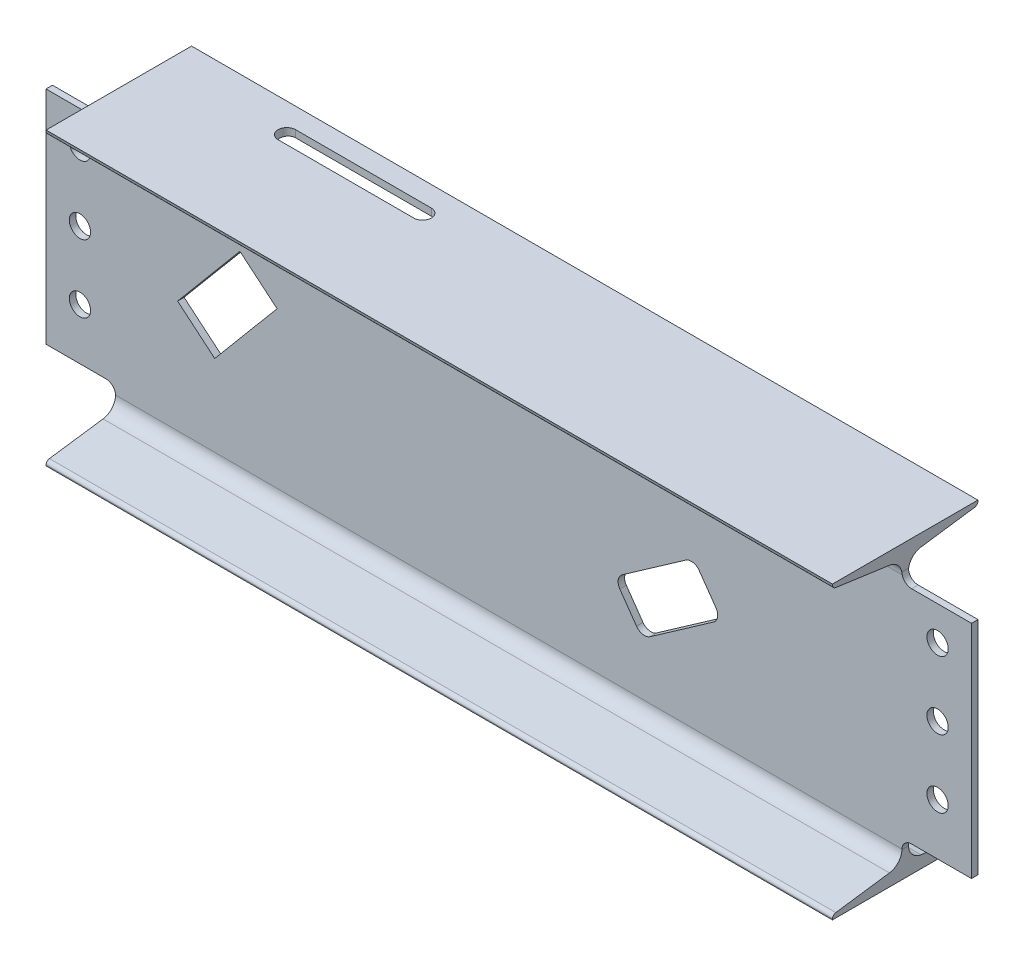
ISO-10303-21;
HEADER;
FILE_DESCRIPTION(('STEP AP214'),'2;1');
FILE_NAME('part.step','',(''),(''),'','','');
FILE_SCHEMA(('AUTOMOTIVE_DESIGN { 1 0 10303 214 1 1 1 1 }'));
ENDSEC;
DATA;
#1=APPLICATION_CONTEXT('core data for automotive mechanical design processes');
#2=APPLICATION_PROTOCOL_DEFINITION('international standard','automotive_design',2000,#1);
#3=PRODUCT_CONTEXT('',#1,'mechanical');
#4=PRODUCT('Part','Part','',(#3));
#5=PRODUCT_RELATED_PRODUCT_CATEGORY('part','',(#4));
#6=PRODUCT_DEFINITION_FORMATION('','',#4);
#7=PRODUCT_DEFINITION_CONTEXT('part definition',#1,'design');
#8=PRODUCT_DEFINITION('design','',#6,#7);
#9=PRODUCT_DEFINITION_SHAPE('','',#8);
#10=(LENGTH_UNIT() NAMED_UNIT(*) SI_UNIT(.MILLI.,.METRE.));
#11=(NAMED_UNIT(*) PLANE_ANGLE_UNIT() SI_UNIT($,.RADIAN.));
#12=(NAMED_UNIT(*) SI_UNIT($,.STERADIAN.) SOLID_ANGLE_UNIT());
#13=UNCERTAINTY_MEASURE_WITH_UNIT(LENGTH_MEASURE(1.E-05),#10,'distance_accuracy_value','');
#14=(GEOMETRIC_REPRESENTATION_CONTEXT(3) GLOBAL_UNCERTAINTY_ASSIGNED_CONTEXT((#13)) GLOBAL_UNIT_ASSIGNED_CONTEXT((#10,
#11,#12)) REPRESENTATION_CONTEXT('',''));
#15=CARTESIAN_POINT('',(0.,0.,0.));
#16=DIRECTION('',(0.,0.,1.));
#17=DIRECTION('',(1.,0.,0.));
#18=AXIS2_PLACEMENT_3D('',#15,#16,#17);
#19=CARTESIAN_POINT('',(1000.,0.,-75.0000000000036));
#20=DIRECTION('',(0.,-1.25028262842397E-13,-1.));
#21=DIRECTION('',(0.,1.,-1.25028262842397E-13));
#22=AXIS2_PLACEMENT_3D('',#19,#20,#21);
#23=PLANE('',#22);
#24=DIRECTION('',(-1.,0.,0.));
#25=VECTOR('',#24,1.);
#26=CARTESIAN_POINT('',(1000.,0.,-75.0000000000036));
#27=LINE('',#26,#25);
#28=CARTESIAN_POINT('',(905.499999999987,0.,-75.));
#29=VERTEX_POINT('',#28);
#30=CARTESIAN_POINT('',(94.5,0.,-75.));
#31=VERTEX_POINT('',#30);
#32=EDGE_CURVE('E687',#29,#31,#27,.T.);
#33=ORIENTED_EDGE('',*,*,#32,.F.);
#34=DIRECTION('',(0.,1.,-1.24917240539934E-13));
#35=VECTOR('',#34,1.);
#36=CARTESIAN_POINT('',(905.499999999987,0.,-75.));
#37=LINE('',#36,#35);
#38=CARTESIAN_POINT('',(905.499999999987,-0.88797764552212,-74.9999999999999));
#39=VERTEX_POINT('',#38);
#40=EDGE_CURVE('E571',#39,#29,#37,.T.);
#41=ORIENTED_EDGE('',*,*,#40,.F.);
#42=DIRECTION('',(-1.,0.,0.));
#43=VECTOR('',#42,1.);
#44=CARTESIAN_POINT('',(1000.,-0.88797764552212,-75.0000000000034));
#45=LINE('',#44,#43);
#46=CARTESIAN_POINT('',(94.4999999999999,-0.88797764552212,-75.0000000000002));
#47=VERTEX_POINT('',#46);
#48=EDGE_CURVE('E919',#39,#47,#45,.T.);
#49=ORIENTED_EDGE('',*,*,#48,.T.);
#50=DIRECTION('',(0.,1.,-1.25028262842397E-13));
#51=VECTOR('',#50,1.);
#52=CARTESIAN_POINT('',(94.5,0.,-75.));
#53=LINE('',#52,#51);
#54=EDGE_CURVE('E801',#47,#31,#53,.T.);
#55=ORIENTED_EDGE('',*,*,#54,.T.);
#56=EDGE_LOOP('',(#33,#41,#49,#55));
#57=FACE_BOUND('',#56,.T.);
#58=ADVANCED_FACE('F101',(#57),#23,.T.);
#59=CARTESIAN_POINT('',(1000.,0.,74.9999999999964));
#60=DIRECTION('',(0.,1.,0.));
#61=DIRECTION('',(0.,0.,1.));
#62=AXIS2_PLACEMENT_3D('',#59,#60,#61);
#63=PLANE('',#62);
#64=CARTESIAN_POINT('',(222.75,0.,-45.));
#65=DIRECTION('',(0.,1.,0.));
#66=DIRECTION('',(0.,0.,1.));
#67=AXIS2_PLACEMENT_3D('',#64,#65,#66);
#68=CIRCLE('',#67,8.99999999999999);
#69=CARTESIAN_POINT('',(222.75,0.,-54.));
#70=VERTEX_POINT('',#69);
#71=CARTESIAN_POINT('',(222.75,0.,-36.));
#72=VERTEX_POINT('',#71);
#73=EDGE_CURVE('E491',#70,#72,#68,.T.);
#74=ORIENTED_EDGE('',*,*,#73,.F.);
#75=DIRECTION('',(-1.,0.,0.));
#76=VECTOR('',#75,1.);
#77=CARTESIAN_POINT('',(222.75,0.,-54.));
#78=LINE('',#77,#76);
#79=CARTESIAN_POINT('',(362.75,0.,-54.));
#80=VERTEX_POINT('',#79);
#81=EDGE_CURVE('E502',#80,#70,#78,.T.);
#82=ORIENTED_EDGE('',*,*,#81,.F.);
#83=CARTESIAN_POINT('',(362.75,0.,-45.));
#84=DIRECTION('',(0.,1.,0.));
#85=DIRECTION('',(0.,0.,1.));
#86=AXIS2_PLACEMENT_3D('',#83,#84,#85);
#87=CIRCLE('',#86,8.99999999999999);
#88=CARTESIAN_POINT('',(362.75,0.,-36.));
#89=VERTEX_POINT('',#88);
#90=EDGE_CURVE('E516',#89,#80,#87,.T.);
#91=ORIENTED_EDGE('',*,*,#90,.F.);
#92=DIRECTION('',(1.,0.,0.));
#93=VECTOR('',#92,1.);
#94=CARTESIAN_POINT('',(222.75,0.,-36.));
#95=LINE('',#94,#93);
#96=EDGE_CURVE('E513',#72,#89,#95,.T.);
#97=ORIENTED_EDGE('',*,*,#96,.F.);
#98=EDGE_LOOP('',(#74,#82,#91,#97));
#99=FACE_BOUND('',#98,.T.);
#100=DIRECTION('',(-1.,0.,0.));
#101=VECTOR('',#100,1.);
#102=CARTESIAN_POINT('',(1000.,0.,74.9999999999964));
#103=LINE('',#102,#101);
#104=CARTESIAN_POINT('',(905.499999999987,0.,75.));
#105=VERTEX_POINT('',#104);
#106=CARTESIAN_POINT('',(94.5,0.,75.));
#107=VERTEX_POINT('',#106);
#108=EDGE_CURVE('E685',#105,#107,#103,.T.);
#109=ORIENTED_EDGE('',*,*,#108,.F.);
#110=DIRECTION('',(0.,0.,-1.));
#111=VECTOR('',#110,1.);
#112=CARTESIAN_POINT('',(905.499999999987,0.,-75.));
#113=LINE('',#112,#111);
#114=EDGE_CURVE('E568',#105,#29,#113,.T.);
#115=ORIENTED_EDGE('',*,*,#114,.T.);
#116=ORIENTED_EDGE('',*,*,#32,.T.);
#117=DIRECTION('',(0.,0.,1.));
#118=VECTOR('',#117,1.);
#119=CARTESIAN_POINT('',(94.5,0.,75.));
#120=LINE('',#119,#118);
#121=EDGE_CURVE('E805',#31,#107,#120,.T.);
#122=ORIENTED_EDGE('',*,*,#121,.T.);
#123=EDGE_LOOP('',(#109,#115,#116,#122));
#124=FACE_BOUND('',#123,.T.);
#125=ADVANCED_FACE('F790',(#99,#124),#63,.T.);
#126=CARTESIAN_POINT('',(1000.,0.,74.9999999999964));
#127=DIRECTION('',(0.,1.25028262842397E-13,-1.));
#128=DIRECTION('',(0.,1.,1.25028262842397E-13));
#129=AXIS2_PLACEMENT_3D('',#126,#127,#128);
#130=PLANE('',#129);
#131=DIRECTION('',(0.,1.,1.25139285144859E-13));
#132=VECTOR('',#131,1.);
#133=CARTESIAN_POINT('',(905.499999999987,0.,75.));
#134=LINE('',#133,#132);
#135=CARTESIAN_POINT('',(905.499999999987,-0.88797764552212,74.9999999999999));
#136=VERTEX_POINT('',#135);
#137=EDGE_CURVE('E565',#136,#105,#134,.T.);
#138=ORIENTED_EDGE('',*,*,#137,.T.);
#139=ORIENTED_EDGE('',*,*,#108,.T.);
#140=DIRECTION('',(0.,1.,1.25028262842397E-13));
#141=VECTOR('',#140,1.);
#142=CARTESIAN_POINT('',(94.5,0.,75.));
#143=LINE('',#142,#141);
#144=CARTESIAN_POINT('',(94.5,-0.88797764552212,74.9999999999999));
#145=VERTEX_POINT('',#144);
#146=EDGE_CURVE('E684',#145,#107,#143,.T.);
#147=ORIENTED_EDGE('',*,*,#146,.F.);
#148=DIRECTION('',(-1.,0.,0.));
#149=VECTOR('',#148,1.);
#150=CARTESIAN_POINT('',(1000.,-0.88797764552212,74.9999999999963));
#151=LINE('',#150,#149);
#152=EDGE_CURVE('E675',#136,#145,#151,.T.);
#153=ORIENTED_EDGE('',*,*,#152,.F.);
#154=EDGE_LOOP('',(#138,#139,#147,#153));
#155=FACE_BOUND('',#154,.T.);
#156=ADVANCED_FACE('F681',(#155),#130,.F.);
#157=CARTESIAN_POINT('',(1000.,-0.887977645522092,70.9999999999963));
#158=DIRECTION('',(-1.,0.,0.));
#159=DIRECTION('',(0.,0.,1.));
#160=AXIS2_PLACEMENT_3D('',#157,#158,#159);
#161=CYLINDRICAL_SURFACE('',#160,3.99999999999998);
#162=DIRECTION('',(-1.,0.,0.));
#163=VECTOR('',#162,1.);
#164=CARTESIAN_POINT('',(1000.,-4.84904992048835,71.5566924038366));
#165=LINE('',#164,#163);
#166=CARTESIAN_POINT('',(905.499999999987,-4.84904992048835,71.5566924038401));
#167=VERTEX_POINT('',#166);
#168=CARTESIAN_POINT('',(94.5,-4.84904992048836,71.5566924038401));
#169=VERTEX_POINT('',#168);
#170=EDGE_CURVE('E677',#167,#169,#165,.T.);
#171=ORIENTED_EDGE('',*,*,#170,.F.);
#172=CARTESIAN_POINT('',(905.499999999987,-0.887977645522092,70.9999999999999));
#173=DIRECTION('',(1.,0.,0.));
#174=DIRECTION('',(0.,-1.,0.));
#175=AXIS2_PLACEMENT_3D('',#172,#173,#174);
#176=CIRCLE('',#175,3.99999999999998);
#177=EDGE_CURVE('E619',#167,#136,#176,.F.);
#178=ORIENTED_EDGE('',*,*,#177,.T.);
#179=ORIENTED_EDGE('',*,*,#152,.T.);
#180=CARTESIAN_POINT('',(94.5,-0.887977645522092,70.9999999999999));
#181=DIRECTION('',(-1.,0.,0.));
#182=DIRECTION('',(0.,-1.,0.));
#183=AXIS2_PLACEMENT_3D('',#180,#181,#182);
#184=CIRCLE('',#183,3.99999999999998);
#185=EDGE_CURVE('E811',#145,#169,#184,.F.);
#186=ORIENTED_EDGE('',*,*,#185,.T.);
#187=EDGE_LOOP('',(#171,#178,#179,#186));
#188=FACE_BOUND('',#187,.T.);
#189=ADVANCED_FACE('F673',(#188),#161,.T.);
#190=CARTESIAN_POINT('',(1000.,-4.84904992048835,71.5566924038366));
#191=DIRECTION('',(0.,0.990268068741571,-0.139173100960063));
#192=DIRECTION('',(0.,0.139173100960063,0.990268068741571));
#193=AXIS2_PLACEMENT_3D('',#190,#191,#192);
#194=PLANE('',#193);
#195=DIRECTION('',(0.,0.139173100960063,0.990268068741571));
#196=VECTOR('',#195,1.);
#197=CARTESIAN_POINT('',(905.499999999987,-4.84904992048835,71.5566924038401));
#198=LINE('',#197,#196);
#199=CARTESIAN_POINT('',(905.499999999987,-12.620155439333,16.2624034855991));
#200=VERTEX_POINT('',#199);
#201=EDGE_CURVE('E559',#200,#167,#198,.T.);
#202=ORIENTED_EDGE('',*,*,#201,.T.);
#203=ORIENTED_EDGE('',*,*,#170,.T.);
#204=DIRECTION('',(0.,0.139173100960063,0.990268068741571));
#205=VECTOR('',#204,1.);
#206=CARTESIAN_POINT('',(94.5,-4.84904992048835,71.5566924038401));
#207=LINE('',#206,#205);
#208=CARTESIAN_POINT('',(94.5,-12.620155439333,16.2624034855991));
#209=VERTEX_POINT('',#208);
#210=EDGE_CURVE('E818',#209,#169,#207,.T.);
#211=ORIENTED_EDGE('',*,*,#210,.F.);
#212=DIRECTION('',(-1.,0.,0.));
#213=VECTOR('',#212,1.);
#214=CARTESIAN_POINT('',(1000.,-12.620155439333,16.2624034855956));
#215=LINE('',#214,#213);
#216=EDGE_CURVE('E689',#200,#209,#215,.T.);
#217=ORIENTED_EDGE('',*,*,#216,.F.);
#218=EDGE_LOOP('',(#202,#203,#211,#217));
#219=FACE_BOUND('',#218,.T.);
#220=ADVANCED_FACE('F1039',(#219),#194,.F.);
#221=CARTESIAN_POINT('',(1000.,-27.4741764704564,18.3499999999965));
#222=DIRECTION('',(-1.,0.,0.));
#223=DIRECTION('',(0.,0.,1.));
#224=AXIS2_PLACEMENT_3D('',#221,#222,#223);
#225=CYLINDRICAL_SURFACE('',#224,14.9999999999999);
#226=CARTESIAN_POINT('',(905.810910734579,-27.4741764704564,3.35000000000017));
#227=CARTESIAN_POINT('',(905.758961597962,-27.2708363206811,3.34997550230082));
#228=CARTESIAN_POINT('',(905.71345879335,-27.0658431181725,3.35413479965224));
#229=CARTESIAN_POINT('',(905.635686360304,-26.6548969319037,3.37099289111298));
#230=CARTESIAN_POINT('',(905.603344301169,-26.4489556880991,3.38364390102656));
#231=CARTESIAN_POINT('',(905.551651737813,-26.0361635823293,3.41765245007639));
#232=CARTESIAN_POINT('',(905.53230123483,-25.8293127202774,3.43900999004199));
#233=CARTESIAN_POINT('',(905.506427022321,-25.4147263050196,3.49056740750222));
#234=CARTESIAN_POINT('',(905.499975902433,-25.2069923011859,3.52081623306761));
#235=CARTESIAN_POINT('',(905.499999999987,-24.9999999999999,3.55545875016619));
#236=B_SPLINE_CURVE_WITH_KNOTS('',3,(#226,#227,#228,#229,#230,#231,#232,#233,#234,#235),
.UNSPECIFIED.,.F.,.F.,(4,2,2,2,4),(0.,0.629476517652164,1.25544024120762,1.88140402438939,
2.51088053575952),.UNSPECIFIED.);
#237=CARTESIAN_POINT('',(905.810910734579,-27.4741764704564,3.35000000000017));
#238=VERTEX_POINT('',#237);
#239=CARTESIAN_POINT('',(905.499999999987,-24.9999999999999,3.55545875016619));
#240=VERTEX_POINT('',#239);
#241=EDGE_CURVE('E610',#238,#240,#236,.T.);
#242=ORIENTED_EDGE('',*,*,#241,.T.);
#243=CARTESIAN_POINT('',(905.499999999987,-27.4741764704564,18.35));
#244=DIRECTION('',(1.,0.,0.));
#245=DIRECTION('',(0.,-1.,0.));
#246=AXIS2_PLACEMENT_3D('',#243,#244,#245);
#247=CIRCLE('',#246,14.9999999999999);
#248=EDGE_CURVE('E562',#240,#200,#247,.T.);
#249=ORIENTED_EDGE('',*,*,#248,.T.);
#250=ORIENTED_EDGE('',*,*,#216,.T.);
#251=CARTESIAN_POINT('',(94.5,-27.4741764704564,18.35));
#252=DIRECTION('',(-1.,0.,0.));
#253=DIRECTION('',(0.,-1.,0.));
#254=AXIS2_PLACEMENT_3D('',#251,#252,#253);
#255=CIRCLE('',#254,14.9999999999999);
#256=CARTESIAN_POINT('',(94.5,-24.9999999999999,3.5554587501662));
#257=VERTEX_POINT('',#256);
#258=EDGE_CURVE('E821',#257,#209,#255,.F.);
#259=ORIENTED_EDGE('',*,*,#258,.F.);
#260=CARTESIAN_POINT('',(94.1890892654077,-27.4741764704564,3.35000000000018));
#261=CARTESIAN_POINT('',(94.2410384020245,-27.2708363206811,3.34997550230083));
#262=CARTESIAN_POINT('',(94.2865412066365,-27.0658431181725,3.35413479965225));
#263=CARTESIAN_POINT('',(94.3643136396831,-26.6548969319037,3.37099289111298));
#264=CARTESIAN_POINT('',(94.3966556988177,-26.4489556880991,3.38364390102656));
#265=CARTESIAN_POINT('',(94.4483482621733,-26.0361635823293,3.4176524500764));
#266=CARTESIAN_POINT('',(94.4676987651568,-25.8293127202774,3.439009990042));
#267=CARTESIAN_POINT('',(94.4935729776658,-25.4147263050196,3.49056740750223));
#268=CARTESIAN_POINT('',(94.5000240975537,-25.2069923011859,3.52081623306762));
#269=CARTESIAN_POINT('',(94.5,-24.9999999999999,3.5554587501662));
#270=B_SPLINE_CURVE_WITH_KNOTS('',3,(#260,#261,#262,#263,#264,#265,#266,#267,#268,#269),
.UNSPECIFIED.,.F.,.F.,(4,2,2,2,4),(0.,0.629476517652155,1.25544024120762,1.88140402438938,
2.5108805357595),.UNSPECIFIED.);
#271=CARTESIAN_POINT('',(94.1890892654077,-27.4741764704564,3.35000000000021));
#272=VERTEX_POINT('',#271);
#273=EDGE_CURVE('E830',#272,#257,#270,.T.);
#274=ORIENTED_EDGE('',*,*,#273,.F.);
#275=DIRECTION('',(-1.,0.,0.));
#276=VECTOR('',#275,1.);
#277=CARTESIAN_POINT('',(1000.,-27.4741764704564,3.34999999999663));
#278=LINE('',#277,#276);
#279=EDGE_CURVE('E976',#238,#272,#278,.T.);
#280=ORIENTED_EDGE('',*,*,#279,.F.);
#281=EDGE_LOOP('',(#242,#249,#250,#259,#274,#280));
#282=FACE_BOUND('',#281,.T.);
#283=ADVANCED_FACE('F973',(#282),#225,.F.);
#284=CARTESIAN_POINT('',(1000.,-272.525823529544,18.3499999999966));
#285=DIRECTION('',(-1.,0.,0.));
#286=DIRECTION('',(0.,0.,1.));
#287=AXIS2_PLACEMENT_3D('',#284,#285,#286);
#288=CYLINDRICAL_SURFACE('',#287,15.);
#289=CARTESIAN_POINT('',(905.499999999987,-272.525823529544,18.3500000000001));
#290=DIRECTION('',(1.,0.,0.));
#291=DIRECTION('',(0.,-1.,0.));
#292=AXIS2_PLACEMENT_3D('',#289,#290,#291);
#293=CIRCLE('',#292,15.);
#294=CARTESIAN_POINT('',(905.499999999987,-273.,3.3574966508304));
#295=VERTEX_POINT('',#294);
#296=CARTESIAN_POINT('',(905.499999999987,-287.379844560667,16.2624034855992));
#297=VERTEX_POINT('',#296);
#298=EDGE_CURVE('E717',#295,#297,#293,.F.);
#299=ORIENTED_EDGE('',*,*,#298,.F.);
#300=CARTESIAN_POINT('',(905.511248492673,-272.525823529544,3.35000000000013));
#301=CARTESIAN_POINT('',(905.50749879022,-272.604828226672,3.34999937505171));
#302=CARTESIAN_POINT('',(905.504686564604,-272.683845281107,3.35062378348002));
#303=CARTESIAN_POINT('',(905.500937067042,-272.841904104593,3.35312266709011));
#304=CARTESIAN_POINT('',(905.499999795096,-272.920945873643,3.35499714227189));
#305=CARTESIAN_POINT('',(905.499999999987,-273.,3.3574966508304));
#306=B_SPLINE_CURVE_WITH_KNOTS('',3,(#300,#301,#302,#303,#304,#305),.UNSPECIFIED.,.F.,.F.,(4,2,
4),(0.,0.237208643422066,0.474417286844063),.UNSPECIFIED.);
#307=CARTESIAN_POINT('',(905.511248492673,-272.525823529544,3.35000000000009));
#308=VERTEX_POINT('',#307);
#309=EDGE_CURVE('E631',#308,#295,#306,.T.);
#310=ORIENTED_EDGE('',*,*,#309,.F.);
#311=DIRECTION('',(-1.,0.,0.));
#312=VECTOR('',#311,1.);
#313=CARTESIAN_POINT('',(1000.,-272.525823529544,3.34999999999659));
#314=LINE('',#313,#312);
#315=CARTESIAN_POINT('',(94.4887515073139,-272.525823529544,3.35000000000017));
#316=VERTEX_POINT('',#315);
#317=EDGE_CURVE('E979',#308,#316,#314,.T.);
#318=ORIENTED_EDGE('',*,*,#317,.T.);
#319=CARTESIAN_POINT('',(94.4887515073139,-272.525823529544,3.35000000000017));
#320=CARTESIAN_POINT('',(94.4925012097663,-272.604828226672,3.34999937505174));
#321=CARTESIAN_POINT('',(94.495313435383,-272.683845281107,3.35062378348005));
#322=CARTESIAN_POINT('',(94.499062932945,-272.841904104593,3.35312266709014));
#323=CARTESIAN_POINT('',(94.5000002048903,-272.920945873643,3.35499714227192));
#324=CARTESIAN_POINT('',(94.5,-273.,3.35749665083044));
#325=B_SPLINE_CURVE_WITH_KNOTS('',3,(#319,#320,#321,#322,#323,#324),.UNSPECIFIED.,.F.,.F.,(4,2,
4),(0.,0.237208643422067,0.474417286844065),.UNSPECIFIED.);
#326=CARTESIAN_POINT('',(94.5,-273.,3.35749665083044));
#327=VERTEX_POINT('',#326);
#328=EDGE_CURVE('E882',#316,#327,#325,.T.);
#329=ORIENTED_EDGE('',*,*,#328,.T.);
#330=CARTESIAN_POINT('',(94.5,-272.525823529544,18.3500000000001));
#331=DIRECTION('',(-1.,0.,0.));
#332=DIRECTION('',(0.,-1.,0.));
#333=AXIS2_PLACEMENT_3D('',#330,#331,#332);
#334=CIRCLE('',#333,15.);
#335=CARTESIAN_POINT('',(94.5,-287.379844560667,16.2624034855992));
#336=VERTEX_POINT('',#335);
#337=EDGE_CURVE('E912',#327,#336,#334,.T.);
#338=ORIENTED_EDGE('',*,*,#337,.T.);
#339=DIRECTION('',(-1.,0.,0.));
#340=VECTOR('',#339,1.);
#341=CARTESIAN_POINT('',(1000.,-287.379844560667,16.2624034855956));
#342=LINE('',#341,#340);
#343=EDGE_CURVE('E981',#297,#336,#342,.T.);
#344=ORIENTED_EDGE('',*,*,#343,.F.);
#345=EDGE_LOOP('',(#299,#310,#318,#329,#338,#344));
#346=FACE_BOUND('',#345,.T.);
#347=ADVANCED_FACE('F1055',(#346),#288,.F.);
#348=CARTESIAN_POINT('',(1000.,-295.150950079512,71.5566924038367));
#349=DIRECTION('',(0.,0.990268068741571,0.139173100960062));
#350=DIRECTION('',(0.,-0.139173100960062,0.990268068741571));
#351=AXIS2_PLACEMENT_3D('',#348,#349,#350);
#352=PLANE('',#351);
#353=DIRECTION('',(-1.,0.,0.));
#354=VECTOR('',#353,1.);
#355=CARTESIAN_POINT('',(1000.,-295.150950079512,71.5566924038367));
#356=LINE('',#355,#354);
#357=CARTESIAN_POINT('',(905.499999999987,-295.150950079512,71.5566924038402));
#358=VERTEX_POINT('',#357);
#359=CARTESIAN_POINT('',(94.5,-295.150950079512,71.5566924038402));
#360=VERTEX_POINT('',#359);
#361=EDGE_CURVE('E985',#358,#360,#356,.T.);
#362=ORIENTED_EDGE('',*,*,#361,.F.);
#363=DIRECTION('',(0.,-0.139173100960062,0.990268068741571));
#364=VECTOR('',#363,1.);
#365=CARTESIAN_POINT('',(905.499999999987,-295.150950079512,71.5566924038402));
#366=LINE('',#365,#364);
#367=EDGE_CURVE('E648',#297,#358,#366,.T.);
#368=ORIENTED_EDGE('',*,*,#367,.F.);
#369=ORIENTED_EDGE('',*,*,#343,.T.);
#370=DIRECTION('',(0.,-0.139173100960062,0.990268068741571));
#371=VECTOR('',#370,1.);
#372=CARTESIAN_POINT('',(94.5,-295.150950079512,71.5566924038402));
#373=LINE('',#372,#371);
#374=EDGE_CURVE('E910',#336,#360,#373,.T.);
#375=ORIENTED_EDGE('',*,*,#374,.T.);
#376=EDGE_LOOP('',(#362,#368,#369,#375));
#377=FACE_BOUND('',#376,.T.);
#378=ADVANCED_FACE('F1101',(#377),#352,.T.);
#379=CARTESIAN_POINT('',(1000.,-299.112022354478,70.9999999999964));
#380=DIRECTION('',(-1.,0.,0.));
#381=DIRECTION('',(0.,0.,1.));
#382=AXIS2_PLACEMENT_3D('',#379,#380,#381);
#383=CYLINDRICAL_SURFACE('',#382,3.99999999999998);
#384=CARTESIAN_POINT('',(905.499999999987,-299.112022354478,71.));
#385=DIRECTION('',(1.,0.,0.));
#386=DIRECTION('',(0.,-1.,0.));
#387=AXIS2_PLACEMENT_3D('',#384,#385,#386);
#388=CIRCLE('',#387,3.99999999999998);
#389=CARTESIAN_POINT('',(905.499999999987,-299.112022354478,74.9999999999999));
#390=VERTEX_POINT('',#389);
#391=EDGE_CURVE('E650',#390,#358,#388,.F.);
#392=ORIENTED_EDGE('',*,*,#391,.T.);
#393=ORIENTED_EDGE('',*,*,#361,.T.);
#394=CARTESIAN_POINT('',(94.5,-299.112022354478,71.));
#395=DIRECTION('',(-1.,0.,0.));
#396=DIRECTION('',(0.,-1.,0.));
#397=AXIS2_PLACEMENT_3D('',#394,#395,#396);
#398=CIRCLE('',#397,3.99999999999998);
#399=CARTESIAN_POINT('',(94.5,-299.112022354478,75.));
#400=VERTEX_POINT('',#399);
#401=EDGE_CURVE('E907',#400,#360,#398,.T.);
#402=ORIENTED_EDGE('',*,*,#401,.F.);
#403=DIRECTION('',(-1.,0.,0.));
#404=VECTOR('',#403,1.);
#405=CARTESIAN_POINT('',(1000.,-299.112022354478,74.9999999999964));
#406=LINE('',#405,#404);
#407=EDGE_CURVE('E987',#390,#400,#406,.T.);
#408=ORIENTED_EDGE('',*,*,#407,.F.);
#409=EDGE_LOOP('',(#392,#393,#402,#408));
#410=FACE_BOUND('',#409,.T.);
#411=ADVANCED_FACE('F1097',(#410),#383,.T.);
#412=CARTESIAN_POINT('',(1000.,-300.,74.9999999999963));
#413=DIRECTION('',(0.,0.,1.));
#414=DIRECTION('',(0.,-1.,0.));
#415=AXIS2_PLACEMENT_3D('',#412,#413,#414);
#416=PLANE('',#415);
#417=DIRECTION('',(-1.,0.,0.));
#418=VECTOR('',#417,1.);
#419=CARTESIAN_POINT('',(1000.,-300.,74.9999999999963));
#420=LINE('',#419,#418);
#421=CARTESIAN_POINT('',(905.499999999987,-300.,74.9999999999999));
#422=VERTEX_POINT('',#421);
#423=CARTESIAN_POINT('',(94.5,-300.,74.9999999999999));
#424=VERTEX_POINT('',#423);
#425=EDGE_CURVE('E989',#422,#424,#420,.T.);
#426=ORIENTED_EDGE('',*,*,#425,.F.);
#427=DIRECTION('',(0.,-1.,0.));
#428=VECTOR('',#427,1.);
#429=CARTESIAN_POINT('',(905.499999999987,-300.,74.9999999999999));
#430=LINE('',#429,#428);
#431=EDGE_CURVE('E653',#390,#422,#430,.T.);
#432=ORIENTED_EDGE('',*,*,#431,.F.);
#433=ORIENTED_EDGE('',*,*,#407,.T.);
#434=DIRECTION('',(0.,-1.,0.));
#435=VECTOR('',#434,1.);
#436=CARTESIAN_POINT('',(94.5,-300.,74.9999999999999));
#437=LINE('',#436,#435);
#438=EDGE_CURVE('E904',#400,#424,#437,.T.);
#439=ORIENTED_EDGE('',*,*,#438,.T.);
#440=EDGE_LOOP('',(#426,#432,#433,#439));
#441=FACE_BOUND('',#440,.T.);
#442=ADVANCED_FACE('F1093',(#441),#416,.T.);
#443=CARTESIAN_POINT('',(1000.,-300.,74.9999999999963));
#444=DIRECTION('',(0.,1.,0.));
#445=DIRECTION('',(0.,0.,1.));
#446=AXIS2_PLACEMENT_3D('',#443,#444,#445);
#447=PLANE('',#446);
#448=DIRECTION('',(-1.,0.,0.));
#449=VECTOR('',#448,1.);
#450=CARTESIAN_POINT('',(222.75,-300.,-54.));
#451=LINE('',#450,#449);
#452=CARTESIAN_POINT('',(362.75,-300.,-54.));
#453=VERTEX_POINT('',#452);
#454=CARTESIAN_POINT('',(222.75,-300.,-54.));
#455=VERTEX_POINT('',#454);
#456=EDGE_CURVE('E508',#453,#455,#451,.T.);
#457=ORIENTED_EDGE('',*,*,#456,.T.);
#458=CARTESIAN_POINT('',(222.75,-300.,-45.));
#459=DIRECTION('',(0.,1.,0.));
#460=DIRECTION('',(0.,0.,1.));
#461=AXIS2_PLACEMENT_3D('',#458,#459,#460);
#462=CIRCLE('',#461,8.99999999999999);
#463=CARTESIAN_POINT('',(222.75,-300.,-36.));
#464=VERTEX_POINT('',#463);
#465=EDGE_CURVE('E498',#455,#464,#462,.T.);
#466=ORIENTED_EDGE('',*,*,#465,.T.);
#467=DIRECTION('',(1.,0.,0.));
#468=VECTOR('',#467,1.);
#469=CARTESIAN_POINT('',(222.75,-300.,-36.));
#470=LINE('',#469,#468);
#471=CARTESIAN_POINT('',(362.75,-300.,-36.));
#472=VERTEX_POINT('',#471);
#473=EDGE_CURVE('E501',#464,#472,#470,.T.);
#474=ORIENTED_EDGE('',*,*,#473,.T.);
#475=CARTESIAN_POINT('',(362.75,-300.,-45.));
#476=DIRECTION('',(0.,1.,0.));
#477=DIRECTION('',(0.,0.,1.));
#478=AXIS2_PLACEMENT_3D('',#475,#476,#477);
#479=CIRCLE('',#478,8.99999999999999);
#480=EDGE_CURVE('E505',#472,#453,#479,.T.);
#481=ORIENTED_EDGE('',*,*,#480,.T.);
#482=EDGE_LOOP('',(#457,#466,#474,#481));
#483=FACE_BOUND('',#482,.T.);
#484=DIRECTION('',(0.,0.,-1.));
#485=VECTOR('',#484,1.);
#486=CARTESIAN_POINT('',(905.499999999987,-300.,-74.9999999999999));
#487=LINE('',#486,#485);
#488=CARTESIAN_POINT('',(905.499999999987,-300.,-74.9999999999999));
#489=VERTEX_POINT('',#488);
#490=EDGE_CURVE('E655',#422,#489,#487,.T.);
#491=ORIENTED_EDGE('',*,*,#490,.F.);
#492=ORIENTED_EDGE('',*,*,#425,.T.);
#493=DIRECTION('',(0.,0.,1.));
#494=VECTOR('',#493,1.);
#495=CARTESIAN_POINT('',(94.5,-300.,74.9999999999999));
#496=LINE('',#495,#494);
#497=CARTESIAN_POINT('',(94.5,-300.,-74.9999999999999));
#498=VERTEX_POINT('',#497);
#499=EDGE_CURVE('E901',#498,#424,#496,.T.);
#500=ORIENTED_EDGE('',*,*,#499,.F.);
#501=DIRECTION('',(-1.,0.,0.));
#502=VECTOR('',#501,1.);
#503=CARTESIAN_POINT('',(1000.,-300.,-75.0000000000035));
#504=LINE('',#503,#502);
#505=EDGE_CURVE('E991',#489,#498,#504,.T.);
#506=ORIENTED_EDGE('',*,*,#505,.F.);
#507=EDGE_LOOP('',(#491,#492,#500,#506));
#508=FACE_BOUND('',#507,.T.);
#509=ADVANCED_FACE('F1088',(#483,#508),#447,.F.);
#510=CARTESIAN_POINT('',(1000.,-300.,-75.0000000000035));
#511=DIRECTION('',(0.,0.,1.));
#512=DIRECTION('',(0.,-1.,0.));
#513=AXIS2_PLACEMENT_3D('',#510,#511,#512);
#514=PLANE('',#513);
#515=DIRECTION('',(0.,-1.,0.));
#516=VECTOR('',#515,1.);
#517=CARTESIAN_POINT('',(905.499999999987,-300.,-74.9999999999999));
#518=LINE('',#517,#516);
#519=CARTESIAN_POINT('',(905.499999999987,-299.112022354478,-75.));
#520=VERTEX_POINT('',#519);
#521=EDGE_CURVE('E657',#520,#489,#518,.T.);
#522=ORIENTED_EDGE('',*,*,#521,.T.);
#523=ORIENTED_EDGE('',*,*,#505,.T.);
#524=DIRECTION('',(0.,-1.,0.));
#525=VECTOR('',#524,1.);
#526=CARTESIAN_POINT('',(94.5,-300.,-74.9999999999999));
#527=LINE('',#526,#525);
#528=CARTESIAN_POINT('',(94.5,-299.112022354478,-75.));
#529=VERTEX_POINT('',#528);
#530=EDGE_CURVE('E898',#529,#498,#527,.T.);
#531=ORIENTED_EDGE('',*,*,#530,.F.);
#532=DIRECTION('',(-1.,0.,0.));
#533=VECTOR('',#532,1.);
#534=CARTESIAN_POINT('',(1000.,-299.112022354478,-75.0000000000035));
#535=LINE('',#534,#533);
#536=EDGE_CURVE('E993',#520,#529,#535,.T.);
#537=ORIENTED_EDGE('',*,*,#536,.F.);
#538=EDGE_LOOP('',(#522,#523,#531,#537));
#539=FACE_BOUND('',#538,.T.);
#540=ADVANCED_FACE('F1084',(#539),#514,.F.);
#541=CARTESIAN_POINT('',(1000.,-299.112022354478,-71.0000000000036));
#542=DIRECTION('',(-1.,0.,0.));
#543=DIRECTION('',(0.,0.,1.));
#544=AXIS2_PLACEMENT_3D('',#541,#542,#543);
#545=CYLINDRICAL_SURFACE('',#544,3.99999999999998);
#546=DIRECTION('',(-1.,0.,0.));
#547=VECTOR('',#546,1.);
#548=CARTESIAN_POINT('',(1000.,-295.150950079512,-71.5566924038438));
#549=LINE('',#548,#547);
#550=CARTESIAN_POINT('',(905.499999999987,-295.150950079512,-71.5566924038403));
#551=VERTEX_POINT('',#550);
#552=CARTESIAN_POINT('',(94.5,-295.150950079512,-71.5566924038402));
#553=VERTEX_POINT('',#552);
#554=EDGE_CURVE('E995',#551,#553,#549,.T.);
#555=ORIENTED_EDGE('',*,*,#554,.F.);
#556=CARTESIAN_POINT('',(905.499999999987,-299.112022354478,-71.));
#557=DIRECTION('',(1.,0.,0.));
#558=DIRECTION('',(0.,-1.,0.));
#559=AXIS2_PLACEMENT_3D('',#556,#557,#558);
#560=CIRCLE('',#559,3.99999999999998);
#561=EDGE_CURVE('E660',#520,#551,#560,.T.);
#562=ORIENTED_EDGE('',*,*,#561,.F.);
#563=ORIENTED_EDGE('',*,*,#536,.T.);
#564=CARTESIAN_POINT('',(94.5,-299.112022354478,-71.));
#565=DIRECTION('',(-1.,0.,0.));
#566=DIRECTION('',(0.,-1.,0.));
#567=AXIS2_PLACEMENT_3D('',#564,#565,#566);
#568=CIRCLE('',#567,3.99999999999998);
#569=EDGE_CURVE('E895',#529,#553,#568,.F.);
#570=ORIENTED_EDGE('',*,*,#569,.T.);
#571=EDGE_LOOP('',(#555,#562,#563,#570));
#572=FACE_BOUND('',#571,.T.);
#573=ADVANCED_FACE('F1079',(#572),#545,.T.);
#574=CARTESIAN_POINT('',(1000.,-295.150950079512,-71.5566924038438));
#575=DIRECTION('',(0.,-0.990268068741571,0.139173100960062));
#576=DIRECTION('',(0.,-0.139173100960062,-0.990268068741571));
#577=AXIS2_PLACEMENT_3D('',#574,#575,#576);
#578=PLANE('',#577);
#579=DIRECTION('',(-1.,0.,0.));
#580=VECTOR('',#579,1.);
#581=CARTESIAN_POINT('',(1000.,-290.153782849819,-36.));
#582=LINE('',#581,#580);
#583=CARTESIAN_POINT('',(362.75,-290.15378284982,-36.));
#584=VERTEX_POINT('',#583);
#585=CARTESIAN_POINT('',(222.75,-290.15378284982,-36.));
#586=VERTEX_POINT('',#585);
#587=EDGE_CURVE('E524',#584,#586,#582,.T.);
#588=ORIENTED_EDGE('',*,*,#587,.T.);
#589=CARTESIAN_POINT('',(222.75,-291.418650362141,-45.));
#590=DIRECTION('',(0.,-0.990268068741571,0.139173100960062));
#591=DIRECTION('',(0.,0.139173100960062,0.990268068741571));
#592=AXIS2_PLACEMENT_3D('',#589,#590,#591);
#593=ELLIPSE('',#592,9.08844815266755,8.99999999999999);
#594=CARTESIAN_POINT('',(222.75,-292.683517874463,-54.));
#595=VERTEX_POINT('',#594);
#596=EDGE_CURVE('E544',#586,#595,#593,.T.);
#597=ORIENTED_EDGE('',*,*,#596,.T.);
#598=DIRECTION('',(1.,0.,0.));
#599=VECTOR('',#598,1.);
#600=CARTESIAN_POINT('',(1000.,-292.683517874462,-54.));
#601=LINE('',#600,#599);
#602=CARTESIAN_POINT('',(362.75,-292.683517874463,-54.));
#603=VERTEX_POINT('',#602);
#604=EDGE_CURVE('E541',#595,#603,#601,.T.);
#605=ORIENTED_EDGE('',*,*,#604,.T.);
#606=CARTESIAN_POINT('',(362.75,-291.418650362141,-45.));
#607=DIRECTION('',(0.,-0.990268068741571,0.139173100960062));
#608=DIRECTION('',(0.,0.139173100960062,0.990268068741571));
#609=AXIS2_PLACEMENT_3D('',#606,#607,#608);
#610=ELLIPSE('',#609,9.08844815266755,8.99999999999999);
#611=EDGE_CURVE('E538',#603,#584,#610,.T.);
#612=ORIENTED_EDGE('',*,*,#611,.T.);
#613=EDGE_LOOP('',(#588,#597,#605,#612));
#614=FACE_BOUND('',#613,.T.);
#615=DIRECTION('',(0.,-0.139173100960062,-0.990268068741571));
#616=VECTOR('',#615,1.);
#617=CARTESIAN_POINT('',(905.499999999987,-295.150950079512,-71.5566924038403));
#618=LINE('',#617,#616);
#619=CARTESIAN_POINT('',(905.499999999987,-287.379844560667,-16.2624034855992));
#620=VERTEX_POINT('',#619);
#621=EDGE_CURVE('E662',#620,#551,#618,.T.);
#622=ORIENTED_EDGE('',*,*,#621,.T.);
#623=ORIENTED_EDGE('',*,*,#554,.T.);
#624=DIRECTION('',(0.,-0.139173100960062,-0.990268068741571));
#625=VECTOR('',#624,1.);
#626=CARTESIAN_POINT('',(94.5,-295.150950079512,-71.5566924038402));
#627=LINE('',#626,#625);
#628=CARTESIAN_POINT('',(94.5,-287.379844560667,-16.2624034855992));
#629=VERTEX_POINT('',#628);
#630=EDGE_CURVE('E892',#629,#553,#627,.T.);
#631=ORIENTED_EDGE('',*,*,#630,.F.);
#632=DIRECTION('',(-1.,0.,0.));
#633=VECTOR('',#632,1.);
#634=CARTESIAN_POINT('',(1000.,-287.379844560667,-16.2624034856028));
#635=LINE('',#634,#633);
#636=EDGE_CURVE('E997',#620,#629,#635,.T.);
#637=ORIENTED_EDGE('',*,*,#636,.F.);
#638=EDGE_LOOP('',(#622,#623,#631,#637));
#639=FACE_BOUND('',#638,.T.);
#640=ADVANCED_FACE('F1075',(#614,#639),#578,.F.);
#641=CARTESIAN_POINT('',(1000.,-272.525823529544,-18.3500000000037));
#642=DIRECTION('',(-1.,0.,0.));
#643=DIRECTION('',(0.,0.,1.));
#644=AXIS2_PLACEMENT_3D('',#641,#642,#643);
#645=CYLINDRICAL_SURFACE('',#644,15.);
#646=CARTESIAN_POINT('',(905.511248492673,-272.525823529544,-3.3500000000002));
#647=CARTESIAN_POINT('',(905.50749879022,-272.604828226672,-3.34999937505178));
#648=CARTESIAN_POINT('',(905.504686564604,-272.683845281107,-3.35062378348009));
#649=CARTESIAN_POINT('',(905.500937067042,-272.841904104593,-3.35312266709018));
#650=CARTESIAN_POINT('',(905.499999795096,-272.920945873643,-3.35499714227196));
#651=CARTESIAN_POINT('',(905.499999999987,-273.,-3.35749665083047));
#652=B_SPLINE_CURVE_WITH_KNOTS('',3,(#646,#647,#648,#649,#650,#651),.UNSPECIFIED.,.F.,.F.,(4,2,
4),(0.,0.237208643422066,0.474417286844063),.UNSPECIFIED.);
#653=CARTESIAN_POINT('',(905.511248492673,-272.525823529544,-3.3500000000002));
#654=VERTEX_POINT('',#653);
#655=CARTESIAN_POINT('',(905.499999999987,-273.,-3.35749665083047));
#656=VERTEX_POINT('',#655);
#657=EDGE_CURVE('E638',#654,#656,#652,.T.);
#658=ORIENTED_EDGE('',*,*,#657,.T.);
#659=CARTESIAN_POINT('',(905.499999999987,-272.525823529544,-18.3500000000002));
#660=DIRECTION('',(1.,0.,0.));
#661=DIRECTION('',(0.,-1.,0.));
#662=AXIS2_PLACEMENT_3D('',#659,#660,#661);
#663=CIRCLE('',#662,15.);
#664=EDGE_CURVE('E664',#656,#620,#663,.T.);
#665=ORIENTED_EDGE('',*,*,#664,.T.);
#666=ORIENTED_EDGE('',*,*,#636,.T.);
#667=CARTESIAN_POINT('',(94.5,-272.525823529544,-18.3500000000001));
#668=DIRECTION('',(-1.,0.,0.));
#669=DIRECTION('',(0.,-1.,0.));
#670=AXIS2_PLACEMENT_3D('',#667,#668,#669);
#671=CIRCLE('',#670,15.);
#672=CARTESIAN_POINT('',(94.5,-273.,-3.35749665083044));
#673=VERTEX_POINT('',#672);
#674=EDGE_CURVE('E704',#673,#629,#671,.F.);
#675=ORIENTED_EDGE('',*,*,#674,.F.);
#676=CARTESIAN_POINT('',(94.4887515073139,-272.525823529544,-3.35000000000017));
#677=CARTESIAN_POINT('',(94.4925012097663,-272.604828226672,-3.34999937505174));
#678=CARTESIAN_POINT('',(94.495313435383,-272.683845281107,-3.35062378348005));
#679=CARTESIAN_POINT('',(94.499062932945,-272.841904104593,-3.35312266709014));
#680=CARTESIAN_POINT('',(94.5000002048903,-272.920945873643,-3.35499714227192));
#681=CARTESIAN_POINT('',(94.5,-273.,-3.35749665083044));
#682=B_SPLINE_CURVE_WITH_KNOTS('',3,(#676,#677,#678,#679,#680,#681),.UNSPECIFIED.,.F.,.F.,(4,2,
4),(0.,0.237208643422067,0.474417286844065),.UNSPECIFIED.);
#683=CARTESIAN_POINT('',(94.4887515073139,-272.525823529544,-3.35000000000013));
#684=VERTEX_POINT('',#683);
#685=EDGE_CURVE('E875',#684,#673,#682,.T.);
#686=ORIENTED_EDGE('',*,*,#685,.F.);
#687=DIRECTION('',(-1.,0.,0.));
#688=VECTOR('',#687,1.);
#689=CARTESIAN_POINT('',(1000.,-272.525823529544,-3.35000000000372));
#690=LINE('',#689,#688);
#691=EDGE_CURVE('E999',#654,#684,#690,.T.);
#692=ORIENTED_EDGE('',*,*,#691,.F.);
#693=EDGE_LOOP('',(#658,#665,#666,#675,#686,#692));
#694=FACE_BOUND('',#693,.T.);
#695=ADVANCED_FACE('F1068',(#694),#645,.F.);
#696=CARTESIAN_POINT('',(1000.,-27.4741764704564,-18.3500000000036));
#697=DIRECTION('',(-1.,0.,0.));
#698=DIRECTION('',(0.,0.,1.));
#699=AXIS2_PLACEMENT_3D('',#696,#697,#698);
#700=CYLINDRICAL_SURFACE('',#699,14.9999999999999);
#701=CARTESIAN_POINT('',(905.499999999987,-27.4741764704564,-18.3500000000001));
#702=DIRECTION('',(1.,0.,0.));
#703=DIRECTION('',(0.,-1.,0.));
#704=AXIS2_PLACEMENT_3D('',#701,#702,#703);
#705=CIRCLE('',#704,14.9999999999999);
#706=CARTESIAN_POINT('',(905.499999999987,-24.9999999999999,-3.5554587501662));
#707=VERTEX_POINT('',#706);
#708=CARTESIAN_POINT('',(905.499999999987,-12.620155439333,-16.2624034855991));
#709=VERTEX_POINT('',#708);
#710=EDGE_CURVE('E578',#707,#709,#705,.F.);
#711=ORIENTED_EDGE('',*,*,#710,.F.);
#712=CARTESIAN_POINT('',(905.810910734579,-27.4741764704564,-3.35000000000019));
#713=CARTESIAN_POINT('',(905.758961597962,-27.2708363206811,-3.34997550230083));
#714=CARTESIAN_POINT('',(905.71345879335,-27.0658431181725,-3.35413479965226));
#715=CARTESIAN_POINT('',(905.635686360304,-26.6548969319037,-3.37099289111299));
#716=CARTESIAN_POINT('',(905.603344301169,-26.4489556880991,-3.38364390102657));
#717=CARTESIAN_POINT('',(905.551651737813,-26.0361635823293,-3.4176524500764));
#718=CARTESIAN_POINT('',(905.53230123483,-25.8293127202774,-3.439009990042));
#719=CARTESIAN_POINT('',(905.506427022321,-25.4147263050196,-3.49056740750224));
#720=CARTESIAN_POINT('',(905.499975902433,-25.2069923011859,-3.52081623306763));
#721=CARTESIAN_POINT('',(905.499999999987,-24.9999999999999,-3.5554587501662));
#722=B_SPLINE_CURVE_WITH_KNOTS('',3,(#712,#713,#714,#715,#716,#717,#718,#719,#720,#721),
.UNSPECIFIED.,.F.,.F.,(4,2,2,2,4),(0.,0.62947651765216,1.25544024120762,1.88140402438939,
2.51088053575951),.UNSPECIFIED.);
#723=CARTESIAN_POINT('',(905.810910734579,-27.4741764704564,-3.35000000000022));
#724=VERTEX_POINT('',#723);
#725=EDGE_CURVE('E585',#724,#707,#722,.T.);
#726=ORIENTED_EDGE('',*,*,#725,.F.);
#727=DIRECTION('',(-1.,0.,0.));
#728=VECTOR('',#727,1.);
#729=CARTESIAN_POINT('',(1000.,-27.4741764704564,-3.35000000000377));
#730=LINE('',#729,#728);
#731=CARTESIAN_POINT('',(94.1890892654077,-27.4741764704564,-3.35000000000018));
#732=VERTEX_POINT('',#731);
#733=EDGE_CURVE('E1001',#724,#732,#730,.T.);
#734=ORIENTED_EDGE('',*,*,#733,.T.);
#735=CARTESIAN_POINT('',(94.1890892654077,-27.4741764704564,-3.35000000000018));
#736=CARTESIAN_POINT('',(94.2410384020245,-27.2708363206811,-3.34997550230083));
#737=CARTESIAN_POINT('',(94.2865412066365,-27.0658431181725,-3.35413479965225));
#738=CARTESIAN_POINT('',(94.3643136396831,-26.6548969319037,-3.37099289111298));
#739=CARTESIAN_POINT('',(94.3966556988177,-26.4489556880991,-3.38364390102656));
#740=CARTESIAN_POINT('',(94.4483482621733,-26.0361635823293,-3.4176524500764));
#741=CARTESIAN_POINT('',(94.4676987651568,-25.8293127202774,-3.439009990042));
#742=CARTESIAN_POINT('',(94.4935729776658,-25.4147263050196,-3.49056740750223));
#743=CARTESIAN_POINT('',(94.5000240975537,-25.2069923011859,-3.52081623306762));
#744=CARTESIAN_POINT('',(94.5,-24.9999999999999,-3.5554587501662));
#745=B_SPLINE_CURVE_WITH_KNOTS('',3,(#735,#736,#737,#738,#739,#740,#741,#742,#743,#744),
.UNSPECIFIED.,.F.,.F.,(4,2,2,2,4),(0.,0.629476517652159,1.25544024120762,1.88140402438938,
2.51088053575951),.UNSPECIFIED.);
#746=CARTESIAN_POINT('',(94.5,-24.9999999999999,-3.5554587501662));
#747=VERTEX_POINT('',#746);
#748=EDGE_CURVE('E854',#732,#747,#745,.T.);
#749=ORIENTED_EDGE('',*,*,#748,.T.);
#750=CARTESIAN_POINT('',(94.5,-27.4741764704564,-18.35));
#751=DIRECTION('',(-1.,0.,0.));
#752=DIRECTION('',(0.,-1.,0.));
#753=AXIS2_PLACEMENT_3D('',#750,#751,#752);
#754=CIRCLE('',#753,14.9999999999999);
#755=CARTESIAN_POINT('',(94.5,-12.620155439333,-16.2624034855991));
#756=VERTEX_POINT('',#755);
#757=EDGE_CURVE('E813',#747,#756,#754,.T.);
#758=ORIENTED_EDGE('',*,*,#757,.T.);
#759=DIRECTION('',(-1.,0.,0.));
#760=VECTOR('',#759,1.);
#761=CARTESIAN_POINT('',(1000.,-12.620155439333,-16.2624034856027));
#762=LINE('',#761,#760);
#763=EDGE_CURVE('E931',#709,#756,#762,.T.);
#764=ORIENTED_EDGE('',*,*,#763,.F.);
#765=EDGE_LOOP('',(#711,#726,#734,#749,#758,#764));
#766=FACE_BOUND('',#765,.T.);
#767=ADVANCED_FACE('F1035',(#766),#700,.F.);
#768=CARTESIAN_POINT('',(1000.,-4.84904992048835,-71.5566924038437));
#769=DIRECTION('',(0.,-0.990268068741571,-0.139173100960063));
#770=DIRECTION('',(0.,0.139173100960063,-0.990268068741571));
#771=AXIS2_PLACEMENT_3D('',#768,#769,#770);
#772=PLANE('',#771);
#773=CARTESIAN_POINT('',(222.75,-8.58134963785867,-45.));
#774=DIRECTION('',(0.,-0.990268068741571,-0.139173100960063));
#775=DIRECTION('',(0.,0.139173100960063,-0.990268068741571));
#776=AXIS2_PLACEMENT_3D('',#773,#774,#775);
#777=ELLIPSE('',#776,9.08844815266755,8.99999999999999);
#778=CARTESIAN_POINT('',(222.75,-9.84621715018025,-36.));
#779=VERTEX_POINT('',#778);
#780=CARTESIAN_POINT('',(222.75,-7.31648212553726,-54.));
#781=VERTEX_POINT('',#780);
#782=EDGE_CURVE('E727',#779,#781,#777,.T.);
#783=ORIENTED_EDGE('',*,*,#782,.F.);
#784=DIRECTION('',(-1.,0.,0.));
#785=VECTOR('',#784,1.);
#786=CARTESIAN_POINT('',(1000.,-9.84621715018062,-36.));
#787=LINE('',#786,#785);
#788=CARTESIAN_POINT('',(362.75,-9.8462171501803,-36.));
#789=VERTEX_POINT('',#788);
#790=EDGE_CURVE('E694',#789,#779,#787,.T.);
#791=ORIENTED_EDGE('',*,*,#790,.F.);
#792=CARTESIAN_POINT('',(362.75,-8.58134963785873,-45.));
#793=DIRECTION('',(0.,-0.990268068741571,-0.139173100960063));
#794=DIRECTION('',(0.,0.139173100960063,-0.990268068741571));
#795=AXIS2_PLACEMENT_3D('',#792,#793,#794);
#796=ELLIPSE('',#795,9.08844815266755,8.99999999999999);
#797=CARTESIAN_POINT('',(362.75,-7.31648212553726,-54.));
#798=VERTEX_POINT('',#797);
#799=EDGE_CURVE('E722',#798,#789,#796,.T.);
#800=ORIENTED_EDGE('',*,*,#799,.F.);
#801=DIRECTION('',(1.,0.,0.));
#802=VECTOR('',#801,1.);
#803=CARTESIAN_POINT('',(1000.,-7.31648212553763,-54.));
#804=LINE('',#803,#802);
#805=EDGE_CURVE('E725',#781,#798,#804,.T.);
#806=ORIENTED_EDGE('',*,*,#805,.F.);
#807=EDGE_LOOP('',(#783,#791,#800,#806));
#808=FACE_BOUND('',#807,.T.);
#809=DIRECTION('',(-1.,0.,0.));
#810=VECTOR('',#809,1.);
#811=CARTESIAN_POINT('',(1000.,-4.84904992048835,-71.5566924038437));
#812=LINE('',#811,#810);
#813=CARTESIAN_POINT('',(905.499999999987,-4.84904992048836,-71.5566924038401));
#814=VERTEX_POINT('',#813);
#815=CARTESIAN_POINT('',(94.5,-4.84904992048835,-71.5566924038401));
#816=VERTEX_POINT('',#815);
#817=EDGE_CURVE('E921',#814,#816,#812,.T.);
#818=ORIENTED_EDGE('',*,*,#817,.F.);
#819=DIRECTION('',(0.,0.139173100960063,-0.990268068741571));
#820=VECTOR('',#819,1.);
#821=CARTESIAN_POINT('',(905.499999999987,-4.84904992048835,-71.5566924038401));
#822=LINE('',#821,#820);
#823=EDGE_CURVE('E576',#709,#814,#822,.T.);
#824=ORIENTED_EDGE('',*,*,#823,.F.);
#825=ORIENTED_EDGE('',*,*,#763,.T.);
#826=DIRECTION('',(0.,0.139173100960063,-0.990268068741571));
#827=VECTOR('',#826,1.);
#828=CARTESIAN_POINT('',(94.5,-4.84904992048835,-71.5566924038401));
#829=LINE('',#828,#827);
#830=EDGE_CURVE('E925',#756,#816,#829,.T.);
#831=ORIENTED_EDGE('',*,*,#830,.T.);
#832=EDGE_LOOP('',(#818,#824,#825,#831));
#833=FACE_BOUND('',#832,.T.);
#834=ADVANCED_FACE('F928',(#808,#833),#772,.T.);
#835=CARTESIAN_POINT('',(1000.,-0.887977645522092,-71.0000000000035));
#836=DIRECTION('',(-1.,0.,0.));
#837=DIRECTION('',(0.,0.,1.));
#838=AXIS2_PLACEMENT_3D('',#835,#836,#837);
#839=CYLINDRICAL_SURFACE('',#838,3.99999999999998);
#840=ORIENTED_EDGE('',*,*,#48,.F.);
#841=CARTESIAN_POINT('',(905.499999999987,-0.887977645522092,-70.9999999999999));
#842=DIRECTION('',(1.,0.,0.));
#843=DIRECTION('',(0.,-1.,0.));
#844=AXIS2_PLACEMENT_3D('',#841,#842,#843);
#845=CIRCLE('',#844,3.99999999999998);
#846=EDGE_CURVE('E573',#39,#814,#845,.F.);
#847=ORIENTED_EDGE('',*,*,#846,.T.);
#848=ORIENTED_EDGE('',*,*,#817,.T.);
#849=CARTESIAN_POINT('',(94.5,-0.887977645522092,-70.9999999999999));
#850=DIRECTION('',(-1.,0.,0.));
#851=DIRECTION('',(0.,-1.,0.));
#852=AXIS2_PLACEMENT_3D('',#849,#850,#851);
#853=CIRCLE('',#852,3.99999999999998);
#854=EDGE_CURVE('E863',#816,#47,#853,.F.);
#855=ORIENTED_EDGE('',*,*,#854,.T.);
#856=EDGE_LOOP('',(#840,#847,#848,#855));
#857=FACE_BOUND('',#856,.T.);
#858=ADVANCED_FACE('F918',(#857),#839,.T.);
#859=CARTESIAN_POINT('',(1000.,-27.4741764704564,3.34999999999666));
#860=DIRECTION('',(0.,0.,-1.));
#861=DIRECTION('',(-1.,0.,0.));
#862=AXIS2_PLACEMENT_3D('',#859,#860,#861);
#863=PLANE('',#862);
#864=DIRECTION('',(0.573576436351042,-0.819152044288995,0.));
#865=VECTOR('',#864,1.);
#866=CARTESIAN_POINT('',(614.55847955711,-185.73576436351,3.35000000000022));
#867=LINE('',#866,#865);
#868=CARTESIAN_POINT('',(614.55847955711,-185.73576436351,3.34999999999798));
#869=VERTEX_POINT('',#868);
#870=CARTESIAN_POINT('',(631.765772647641,-210.31032569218,3.35000000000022));
#871=VERTEX_POINT('',#870);
#872=EDGE_CURVE('E440',#869,#871,#867,.T.);
#873=ORIENTED_EDGE('',*,*,#872,.F.);
#874=CARTESIAN_POINT('',(622.75,-180.,3.35000000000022));
#875=DIRECTION('',(0.,0.,1.));
#876=DIRECTION('',(1.,0.,0.));
#877=AXIS2_PLACEMENT_3D('',#874,#875,#876);
#878=CIRCLE('',#877,10.0000000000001);
#879=CARTESIAN_POINT('',(617.01423563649,-171.80847955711,3.35000000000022));
#880=VERTEX_POINT('',#879);
#881=EDGE_CURVE('E115',#880,#869,#878,.T.);
#882=ORIENTED_EDGE('',*,*,#881,.F.);
#883=DIRECTION('',(-0.819152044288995,-0.573576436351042,0.));
#884=VECTOR('',#883,1.);
#885=CARTESIAN_POINT('',(617.01423563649,-171.80847955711,3.35000000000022));
#886=LINE('',#885,#884);
#887=CARTESIAN_POINT('',(682.546399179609,-125.922364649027,3.35000000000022));
#888=VERTEX_POINT('',#887);
#889=EDGE_CURVE('E462',#888,#880,#886,.T.);
#890=ORIENTED_EDGE('',*,*,#889,.F.);
#891=CARTESIAN_POINT('',(688.28216354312,-134.113885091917,3.35000000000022));
#892=DIRECTION('',(0.,0.,1.));
#893=DIRECTION('',(1.,0.,0.));
#894=AXIS2_PLACEMENT_3D('',#891,#892,#893);
#895=CIRCLE('',#894,10.);
#896=CARTESIAN_POINT('',(696.47368398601,-128.378120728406,3.35000000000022));
#897=VERTEX_POINT('',#896);
#898=EDGE_CURVE('E459',#897,#888,#895,.T.);
#899=ORIENTED_EDGE('',*,*,#898,.F.);
#900=DIRECTION('',(-0.573576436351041,0.819152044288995,0.));
#901=VECTOR('',#900,1.);
#902=CARTESIAN_POINT('',(696.47368398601,-128.378120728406,3.35000000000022));
#903=LINE('',#902,#901);
#904=CARTESIAN_POINT('',(713.680977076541,-152.952682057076,3.35000000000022));
#905=VERTEX_POINT('',#904);
#906=EDGE_CURVE('E456',#905,#897,#903,.T.);
#907=ORIENTED_EDGE('',*,*,#906,.F.);
#908=CARTESIAN_POINT('',(705.489456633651,-158.688446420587,3.35000000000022));
#909=DIRECTION('',(0.,0.,1.));
#910=DIRECTION('',(-1.,0.,0.));
#911=AXIS2_PLACEMENT_3D('',#908,#909,#910);
#912=CIRCLE('',#911,10.);
#913=CARTESIAN_POINT('',(711.225220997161,-166.879966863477,3.35000000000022));
#914=VERTEX_POINT('',#913);
#915=EDGE_CURVE('E450',#914,#905,#912,.T.);
#916=ORIENTED_EDGE('',*,*,#915,.F.);
#917=DIRECTION('',(0.819152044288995,0.573576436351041,0.));
#918=VECTOR('',#917,1.);
#919=CARTESIAN_POINT('',(645.693057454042,-212.76608177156,3.35000000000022));
#920=LINE('',#919,#918);
#921=CARTESIAN_POINT('',(645.693057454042,-212.76608177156,3.35000000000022));
#922=VERTEX_POINT('',#921);
#923=EDGE_CURVE('E448',#922,#914,#920,.T.);
#924=ORIENTED_EDGE('',*,*,#923,.F.);
#925=CARTESIAN_POINT('',(639.957293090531,-204.57456132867,3.35000000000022));
#926=DIRECTION('',(0.,0.,1.));
#927=DIRECTION('',(1.,0.,0.));
#928=AXIS2_PLACEMENT_3D('',#925,#926,#927);
#929=CIRCLE('',#928,10.0000000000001);
#930=EDGE_CURVE('E431',#871,#922,#929,.T.);
#931=ORIENTED_EDGE('',*,*,#930,.F.);
#932=EDGE_LOOP('',(#873,#882,#890,#899,#907,#916,#924,#931));
#933=FACE_BOUND('',#932,.T.);
#934=DIRECTION('',(0.766044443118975,-0.642787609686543,0.));
#935=VECTOR('',#934,1.);
#936=CARTESIAN_POINT('',(158.471239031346,-156.604444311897,3.35000000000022));
#937=LINE('',#936,#935);
#938=CARTESIAN_POINT('',(158.471239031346,-156.604444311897,3.34999999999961));
#939=VERTEX_POINT('',#938);
#940=CARTESIAN_POINT('',(196.773461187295,-188.743824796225,3.35000000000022));
#941=VERTEX_POINT('',#940);
#942=EDGE_CURVE('E479',#939,#941,#937,.T.);
#943=ORIENTED_EDGE('',*,*,#942,.F.);
#944=DIRECTION('',(-0.642787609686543,-0.766044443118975,0.));
#945=VECTOR('',#944,1.);
#946=CARTESIAN_POINT('',(158.471239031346,-156.604444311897,3.35000000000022));
#947=LINE('',#946,#945);
#948=CARTESIAN_POINT('',(222.75,-80.,3.35000000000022));
#949=VERTEX_POINT('',#948);
#950=EDGE_CURVE('E467',#949,#939,#947,.T.);
#951=ORIENTED_EDGE('',*,*,#950,.F.);
#952=DIRECTION('',(-0.766044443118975,0.642787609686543,0.));
#953=VECTOR('',#952,1.);
#954=CARTESIAN_POINT('',(222.75,-80.,3.35000000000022));
#955=LINE('',#954,#953);
#956=CARTESIAN_POINT('',(261.052222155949,-112.139380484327,3.35000000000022));
#957=VERTEX_POINT('',#956);
#958=EDGE_CURVE('E485',#957,#949,#955,.T.);
#959=ORIENTED_EDGE('',*,*,#958,.F.);
#960=DIRECTION('',(0.642787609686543,0.766044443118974,0.));
#961=VECTOR('',#960,1.);
#962=CARTESIAN_POINT('',(196.773461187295,-188.743824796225,3.35000000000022));
#963=LINE('',#962,#961);
#964=EDGE_CURVE('E482',#941,#957,#963,.T.);
#965=ORIENTED_EDGE('',*,*,#964,.F.);
#966=EDGE_LOOP('',(#943,#951,#959,#965));
#967=FACE_BOUND('',#966,.T.);
#968=CARTESIAN_POINT('',(57.7500000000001,-210.,3.34999999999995));
#969=DIRECTION('',(0.,0.,-1.));
#970=DIRECTION('',(-1.,0.,0.));
#971=AXIS2_PLACEMENT_3D('',#968,#969,#970);
#972=CIRCLE('',#971,11.);
#973=CARTESIAN_POINT('',(46.75,-210.,3.34999999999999));
#974=VERTEX_POINT('',#973);
#975=EDGE_CURVE('E698',#974,#974,#972,.F.);
#976=ORIENTED_EDGE('',*,*,#975,.F.);
#977=EDGE_LOOP('',(#976));
#978=FACE_BOUND('',#977,.T.);
#979=CARTESIAN_POINT('',(57.7500000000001,-140.,3.34999999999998));
#980=DIRECTION('',(0.,0.,-1.));
#981=DIRECTION('',(-1.,0.,0.));
#982=AXIS2_PLACEMENT_3D('',#979,#980,#981);
#983=CIRCLE('',#982,11.);
#984=CARTESIAN_POINT('',(46.75,-140.,3.35000000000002));
#985=VERTEX_POINT('',#984);
#986=EDGE_CURVE('E703',#985,#985,#983,.F.);
#987=ORIENTED_EDGE('',*,*,#986,.F.);
#988=EDGE_LOOP('',(#987));
#989=FACE_BOUND('',#988,.T.);
#990=CARTESIAN_POINT('',(57.7500000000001,-70.,3.34999999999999));
#991=DIRECTION('',(0.,0.,-1.));
#992=DIRECTION('',(-1.,0.,0.));
#993=AXIS2_PLACEMENT_3D('',#990,#991,#992);
#994=CIRCLE('',#993,11.);
#995=CARTESIAN_POINT('',(46.7500000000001,-70.,3.35000000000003));
#996=VERTEX_POINT('',#995);
#997=EDGE_CURVE('E699',#996,#996,#994,.F.);
#998=ORIENTED_EDGE('',*,*,#997,.F.);
#999=EDGE_LOOP('',(#998));
#1000=FACE_BOUND('',#999,.T.);
#1001=CARTESIAN_POINT('',(942.249999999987,-140.,3.34999999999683));
#1002=DIRECTION('',(0.,0.,-1.));
#1003=DIRECTION('',(-1.,0.,0.));
#1004=AXIS2_PLACEMENT_3D('',#1001,#1002,#1003);
#1005=CIRCLE('',#1004,11.);
#1006=CARTESIAN_POINT('',(931.249999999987,-140.,3.34999999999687));
#1007=VERTEX_POINT('',#1006);
#1008=EDGE_CURVE('E711',#1007,#1007,#1005,.F.);
#1009=ORIENTED_EDGE('',*,*,#1008,.F.);
#1010=EDGE_LOOP('',(#1009));
#1011=FACE_BOUND('',#1010,.T.);
#1012=CARTESIAN_POINT('',(942.249999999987,-70.,3.34999999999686));
#1013=DIRECTION('',(0.,0.,-1.));
#1014=DIRECTION('',(-1.,0.,0.));
#1015=AXIS2_PLACEMENT_3D('',#1012,#1013,#1014);
#1016=CIRCLE('',#1015,11.);
#1017=CARTESIAN_POINT('',(931.249999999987,-70.,3.34999999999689));
#1018=VERTEX_POINT('',#1017);
#1019=EDGE_CURVE('E716',#1018,#1018,#1016,.F.);
#1020=ORIENTED_EDGE('',*,*,#1019,.F.);
#1021=EDGE_LOOP('',(#1020));
#1022=FACE_BOUND('',#1021,.T.);
#1023=CARTESIAN_POINT('',(942.249999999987,-210.,3.34999999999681));
#1024=DIRECTION('',(0.,0.,-1.));
#1025=DIRECTION('',(-1.,0.,0.));
#1026=AXIS2_PLACEMENT_3D('',#1023,#1024,#1025);
#1027=CIRCLE('',#1026,11.);
#1028=CARTESIAN_POINT('',(931.249999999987,-210.,3.34999999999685));
#1029=VERTEX_POINT('',#1028);
#1030=EDGE_CURVE('E712',#1029,#1029,#1027,.F.);
#1031=ORIENTED_EDGE('',*,*,#1030,.F.);
#1032=EDGE_LOOP('',(#1031));
#1033=FACE_BOUND('',#1032,.T.);
#1034=CARTESIAN_POINT('',(915.499999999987,-273.,3.3500000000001));
#1035=DIRECTION('',(0.,0.,1.));
#1036=DIRECTION('',(0.,1.,0.));
#1037=AXIS2_PLACEMENT_3D('',#1034,#1035,#1036);
#1038=CIRCLE('',#1037,9.99999999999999);
#1039=CARTESIAN_POINT('',(915.499999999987,-263.,3.3500000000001));
#1040=VERTEX_POINT('',#1039);
#1041=EDGE_CURVE('E953',#308,#1040,#1038,.F.);
#1042=ORIENTED_EDGE('',*,*,#1041,.T.);
#1043=DIRECTION('',(1.,0.,0.));
#1044=VECTOR('',#1043,1.);
#1045=CARTESIAN_POINT('',(799.999999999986,-263.,3.3500000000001));
#1046=LINE('',#1045,#1044);
#1047=CARTESIAN_POINT('',(977.249999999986,-263.,3.35000000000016));
#1048=VERTEX_POINT('',#1047);
#1049=EDGE_CURVE('E956',#1040,#1048,#1046,.T.);
#1050=ORIENTED_EDGE('',*,*,#1049,.T.);
#1051=DIRECTION('',(0.,1.,0.));
#1052=VECTOR('',#1051,1.);
#1053=CARTESIAN_POINT('',(977.249999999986,-27.4741764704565,3.35000000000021));
#1054=LINE('',#1053,#1052);
#1055=CARTESIAN_POINT('',(977.249999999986,-35.,3.35000000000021));
#1056=VERTEX_POINT('',#1055);
#1057=EDGE_CURVE('E958',#1048,#1056,#1054,.T.);
#1058=ORIENTED_EDGE('',*,*,#1057,.T.);
#1059=DIRECTION('',(-1.,0.,0.));
#1060=VECTOR('',#1059,1.);
#1061=CARTESIAN_POINT('',(799.999999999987,-35.,3.3500000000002));
#1062=LINE('',#1061,#1060);
#1063=CARTESIAN_POINT('',(915.499999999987,-35.,3.3500000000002));
#1064=VERTEX_POINT('',#1063);
#1065=EDGE_CURVE('E618',#1056,#1064,#1062,.T.);
#1066=ORIENTED_EDGE('',*,*,#1065,.T.);
#1067=CARTESIAN_POINT('',(915.499999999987,-24.9999999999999,3.35000000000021));
#1068=DIRECTION('',(0.,0.,1.));
#1069=DIRECTION('',(0.,1.,0.));
#1070=AXIS2_PLACEMENT_3D('',#1067,#1068,#1069);
#1071=CIRCLE('',#1070,10.);
#1072=EDGE_CURVE('E580',#1064,#238,#1071,.F.);
#1073=ORIENTED_EDGE('',*,*,#1072,.T.);
#1074=ORIENTED_EDGE('',*,*,#279,.T.);
#1075=CARTESIAN_POINT('',(84.5,-24.9999999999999,3.35000000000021));
#1076=DIRECTION('',(0.,0.,-1.));
#1077=DIRECTION('',(0.,1.,0.));
#1078=AXIS2_PLACEMENT_3D('',#1075,#1076,#1077);
#1079=CIRCLE('',#1078,10.);
#1080=CARTESIAN_POINT('',(84.5,-35.,3.35000000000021));
#1081=VERTEX_POINT('',#1080);
#1082=EDGE_CURVE('E827',#1081,#272,#1079,.F.);
#1083=ORIENTED_EDGE('',*,*,#1082,.F.);
#1084=DIRECTION('',(1.,0.,0.));
#1085=VECTOR('',#1084,1.);
#1086=CARTESIAN_POINT('',(200.,-35.,3.35000000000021));
#1087=LINE('',#1086,#1085);
#1088=CARTESIAN_POINT('',(22.7500000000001,-35.,3.35000000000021));
#1089=VERTEX_POINT('',#1088);
#1090=EDGE_CURVE('E838',#1089,#1081,#1087,.T.);
#1091=ORIENTED_EDGE('',*,*,#1090,.F.);
#1092=DIRECTION('',(0.,1.,0.));
#1093=VECTOR('',#1092,1.);
#1094=CARTESIAN_POINT('',(22.7500000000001,-27.4741764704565,3.35000000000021));
#1095=LINE('',#1094,#1093);
#1096=CARTESIAN_POINT('',(22.7500000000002,-263.,3.35000000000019));
#1097=VERTEX_POINT('',#1096);
#1098=EDGE_CURVE('E1043',#1097,#1089,#1095,.T.);
#1099=ORIENTED_EDGE('',*,*,#1098,.F.);
#1100=DIRECTION('',(-1.,0.,0.));
#1101=VECTOR('',#1100,1.);
#1102=CARTESIAN_POINT('',(200.,-263.,3.35000000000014));
#1103=LINE('',#1102,#1101);
#1104=CARTESIAN_POINT('',(84.5,-263.,3.35000000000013));
#1105=VERTEX_POINT('',#1104);
#1106=EDGE_CURVE('E883',#1105,#1097,#1103,.T.);
#1107=ORIENTED_EDGE('',*,*,#1106,.F.);
#1108=CARTESIAN_POINT('',(84.5,-273.,3.35000000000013));
#1109=DIRECTION('',(0.,0.,-1.));
#1110=DIRECTION('',(0.,1.,0.));
#1111=AXIS2_PLACEMENT_3D('',#1108,#1109,#1110);
#1112=CIRCLE('',#1111,9.99999999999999);
#1113=EDGE_CURVE('E889',#316,#1105,#1112,.F.);
#1114=ORIENTED_EDGE('',*,*,#1113,.F.);
#1115=ORIENTED_EDGE('',*,*,#317,.F.);
#1116=EDGE_LOOP('',(#1042,#1050,#1058,#1066,#1073,#1074,#1083,#1091,#1099,#1107,#1114,#1115));
#1117=FACE_BOUND('',#1116,.T.);
#1118=ADVANCED_FACE('F444',(#933,#967,#978,#989,#1000,#1011,#1022,#1033,#1117),#863,.F.);
#1119=CARTESIAN_POINT('',(1000.,-27.4741764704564,-3.35000000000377));
#1120=DIRECTION('',(0.,0.,-1.));
#1121=DIRECTION('',(-1.,0.,0.));
#1122=AXIS2_PLACEMENT_3D('',#1119,#1120,#1121);
#1123=PLANE('',#1122);
#1124=CARTESIAN_POINT('',(622.75,-180.,-3.35000000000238));
#1125=DIRECTION('',(0.,0.,-1.));
#1126=DIRECTION('',(-1.,0.,0.));
#1127=AXIS2_PLACEMENT_3D('',#1124,#1125,#1126);
#1128=CIRCLE('',#1127,10.0000000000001);
#1129=CARTESIAN_POINT('',(614.55847955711,-185.73576436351,-3.35000000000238));
#1130=VERTEX_POINT('',#1129);
#1131=CARTESIAN_POINT('',(617.01423563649,-171.80847955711,-3.35000000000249));
#1132=VERTEX_POINT('',#1131);
#1133=EDGE_CURVE('E12',#1130,#1132,#1128,.T.);
#1134=ORIENTED_EDGE('',*,*,#1133,.F.);
#1135=DIRECTION('',(-0.573576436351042,0.819152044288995,0.));
#1136=VECTOR('',#1135,1.);
#1137=CARTESIAN_POINT('',(667.006234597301,-260.638921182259,-3.35000000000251));
#1138=LINE('',#1137,#1136);
#1139=CARTESIAN_POINT('',(631.765772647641,-210.31032569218,-3.3500000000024));
#1140=VERTEX_POINT('',#1139);
#1141=EDGE_CURVE('E738',#1140,#1130,#1138,.T.);
#1142=ORIENTED_EDGE('',*,*,#1141,.F.);
#1143=CARTESIAN_POINT('',(639.957293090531,-204.57456132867,-3.35000000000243));
#1144=DIRECTION('',(0.,0.,-1.));
#1145=DIRECTION('',(-1.,0.,0.));
#1146=AXIS2_PLACEMENT_3D('',#1143,#1144,#1145);
#1147=CIRCLE('',#1146,10.0000000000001);
#1148=CARTESIAN_POINT('',(645.693057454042,-212.76608177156,-3.35000000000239));
#1149=VERTEX_POINT('',#1148);
#1150=EDGE_CURVE('E434',#1149,#1140,#1147,.T.);
#1151=ORIENTED_EDGE('',*,*,#1150,.F.);
#1152=DIRECTION('',(-0.819152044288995,-0.573576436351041,0.));
#1153=VECTOR('',#1152,1.);
#1154=CARTESIAN_POINT('',(970.495302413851,14.6628985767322,-3.35000000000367));
#1155=LINE('',#1154,#1153);
#1156=CARTESIAN_POINT('',(711.225220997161,-166.879966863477,-3.35000000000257));
#1157=VERTEX_POINT('',#1156);
#1158=EDGE_CURVE('E741',#1157,#1149,#1155,.T.);
#1159=ORIENTED_EDGE('',*,*,#1158,.F.);
#1160=CARTESIAN_POINT('',(705.489456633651,-158.688446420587,-3.35000000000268));
#1161=DIRECTION('',(0.,0.,-1.));
#1162=DIRECTION('',(-1.,0.,0.));
#1163=AXIS2_PLACEMENT_3D('',#1160,#1161,#1162);
#1164=CIRCLE('',#1163,10.);
#1165=CARTESIAN_POINT('',(713.680977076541,-152.952682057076,-3.35000000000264));
#1166=VERTEX_POINT('',#1165);
#1167=EDGE_CURVE('E743',#1166,#1157,#1164,.T.);
#1168=ORIENTED_EDGE('',*,*,#1167,.F.);
#1169=DIRECTION('',(0.573576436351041,-0.819152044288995,0.));
#1170=VECTOR('',#1169,1.);
#1171=CARTESIAN_POINT('',(748.921439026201,-203.281277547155,-3.35000000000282));
#1172=LINE('',#1171,#1170);
#1173=CARTESIAN_POINT('',(696.47368398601,-128.378120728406,-3.35000000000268));
#1174=VERTEX_POINT('',#1173);
#1175=EDGE_CURVE('E745',#1174,#1166,#1172,.T.);
#1176=ORIENTED_EDGE('',*,*,#1175,.F.);
#1177=CARTESIAN_POINT('',(688.28216354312,-134.113885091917,-3.35000000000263));
#1178=DIRECTION('',(0.,0.,-1.));
#1179=DIRECTION('',(-1.,0.,0.));
#1180=AXIS2_PLACEMENT_3D('',#1177,#1178,#1179);
#1181=CIRCLE('',#1180,10.);
#1182=CARTESIAN_POINT('',(682.546399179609,-125.922364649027,-3.35000000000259));
#1183=VERTEX_POINT('',#1182);
#1184=EDGE_CURVE('E747',#1183,#1174,#1181,.T.);
#1185=ORIENTED_EDGE('',*,*,#1184,.F.);
#1186=DIRECTION('',(0.819152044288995,0.573576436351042,0.));
#1187=VECTOR('',#1186,1.);
#1188=CARTESIAN_POINT('',(941.816480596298,55.6205007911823,-3.35000000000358));
#1189=LINE('',#1188,#1187);
#1190=EDGE_CURVE('E108',#1132,#1183,#1189,.T.);
#1191=ORIENTED_EDGE('',*,*,#1190,.F.);
#1192=EDGE_LOOP('',(#1134,#1142,#1151,#1159,#1168,#1176,#1185,#1191));
#1193=FACE_BOUND('',#1192,.T.);
#1194=DIRECTION('',(0.642787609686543,0.766044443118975,0.));
#1195=VECTOR('',#1194,1.);
#1196=CARTESIAN_POINT('',(569.754896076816,333.544331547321,-3.35000000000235));
#1197=LINE('',#1196,#1195);
#1198=CARTESIAN_POINT('',(158.471239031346,-156.604444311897,-3.3500000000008));
#1199=VERTEX_POINT('',#1198);
#1200=CARTESIAN_POINT('',(222.75,-80.,-3.35000000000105));
#1201=VERTEX_POINT('',#1200);
#1202=EDGE_CURVE('E736',#1199,#1201,#1197,.T.);
#1203=ORIENTED_EDGE('',*,*,#1202,.F.);
#1204=DIRECTION('',(-0.766044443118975,0.642787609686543,0.));
#1205=VECTOR('',#1204,1.);
#1206=CARTESIAN_POINT('',(588.71634295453,-517.622952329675,-3.35000000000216));
#1207=LINE('',#1206,#1205);
#1208=CARTESIAN_POINT('',(196.773461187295,-188.743824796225,-3.35000000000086));
#1209=VERTEX_POINT('',#1208);
#1210=EDGE_CURVE('E729',#1209,#1199,#1207,.T.);
#1211=ORIENTED_EDGE('',*,*,#1210,.F.);
#1212=DIRECTION('',(-0.642787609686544,-0.766044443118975,0.));
#1213=VECTOR('',#1212,1.);
#1214=CARTESIAN_POINT('',(608.057118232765,301.404951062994,-3.35000000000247));
#1215=LINE('',#1214,#1213);
#1216=CARTESIAN_POINT('',(261.052222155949,-112.139380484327,-3.35000000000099));
#1217=VERTEX_POINT('',#1216);
#1218=EDGE_CURVE('E731',#1217,#1209,#1215,.T.);
#1219=ORIENTED_EDGE('',*,*,#1218,.F.);
#1220=DIRECTION('',(0.766044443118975,-0.642787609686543,0.));
#1221=VECTOR('',#1220,1.);
#1222=CARTESIAN_POINT('',(652.995103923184,-441.018508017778,-3.35000000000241));
#1223=LINE('',#1222,#1221);
#1224=EDGE_CURVE('E734',#1201,#1217,#1223,.T.);
#1225=ORIENTED_EDGE('',*,*,#1224,.F.);
#1226=EDGE_LOOP('',(#1203,#1211,#1219,#1225));
#1227=FACE_BOUND('',#1226,.T.);
#1228=CARTESIAN_POINT('',(942.249999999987,-210.,-3.3500000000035));
#1229=DIRECTION('',(0.,0.,-1.));
#1230=DIRECTION('',(-1.,0.,0.));
#1231=AXIS2_PLACEMENT_3D('',#1228,#1229,#1230);
#1232=CIRCLE('',#1231,11.);
#1233=CARTESIAN_POINT('',(931.249999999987,-210.,-3.35000000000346));
#1234=VERTEX_POINT('',#1233);
#1235=EDGE_CURVE('E718',#1234,#1234,#1232,.F.);
#1236=ORIENTED_EDGE('',*,*,#1235,.T.);
#1237=EDGE_LOOP('',(#1236));
#1238=FACE_BOUND('',#1237,.T.);
#1239=CARTESIAN_POINT('',(942.249999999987,-70.,-3.35000000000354));
#1240=DIRECTION('',(0.,0.,-1.));
#1241=DIRECTION('',(-1.,0.,0.));
#1242=AXIS2_PLACEMENT_3D('',#1239,#1240,#1241);
#1243=CIRCLE('',#1242,11.);
#1244=CARTESIAN_POINT('',(931.249999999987,-70.,-3.35000000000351));
#1245=VERTEX_POINT('',#1244);
#1246=EDGE_CURVE('E713',#1245,#1245,#1243,.F.);
#1247=ORIENTED_EDGE('',*,*,#1246,.T.);
#1248=EDGE_LOOP('',(#1247));
#1249=FACE_BOUND('',#1248,.T.);
#1250=CARTESIAN_POINT('',(942.249999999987,-140.,-3.35000000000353));
#1251=DIRECTION('',(0.,0.,-1.));
#1252=DIRECTION('',(-1.,0.,0.));
#1253=AXIS2_PLACEMENT_3D('',#1250,#1251,#1252);
#1254=CIRCLE('',#1253,11.);
#1255=CARTESIAN_POINT('',(931.249999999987,-140.,-3.35000000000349));
#1256=VERTEX_POINT('',#1255);
#1257=EDGE_CURVE('E708',#1256,#1256,#1254,.F.);
#1258=ORIENTED_EDGE('',*,*,#1257,.T.);
#1259=EDGE_LOOP('',(#1258));
#1260=FACE_BOUND('',#1259,.T.);
#1261=CARTESIAN_POINT('',(57.7500000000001,-70.,-3.35000000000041));
#1262=DIRECTION('',(0.,0.,-1.));
#1263=DIRECTION('',(-1.,0.,0.));
#1264=AXIS2_PLACEMENT_3D('',#1261,#1262,#1263);
#1265=CIRCLE('',#1264,11.);
#1266=CARTESIAN_POINT('',(46.7500000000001,-70.,-3.35000000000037));
#1267=VERTEX_POINT('',#1266);
#1268=EDGE_CURVE('E705',#1267,#1267,#1265,.F.);
#1269=ORIENTED_EDGE('',*,*,#1268,.T.);
#1270=EDGE_LOOP('',(#1269));
#1271=FACE_BOUND('',#1270,.T.);
#1272=CARTESIAN_POINT('',(57.7500000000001,-140.,-3.35000000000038));
#1273=DIRECTION('',(0.,0.,-1.));
#1274=DIRECTION('',(-1.,0.,0.));
#1275=AXIS2_PLACEMENT_3D('',#1272,#1273,#1274);
#1276=CIRCLE('',#1275,11.);
#1277=CARTESIAN_POINT('',(46.75,-140.,-3.35000000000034));
#1278=VERTEX_POINT('',#1277);
#1279=EDGE_CURVE('E700',#1278,#1278,#1276,.F.);
#1280=ORIENTED_EDGE('',*,*,#1279,.T.);
#1281=EDGE_LOOP('',(#1280));
#1282=FACE_BOUND('',#1281,.T.);
#1283=CARTESIAN_POINT('',(57.7500000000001,-210.,-3.35000000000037));
#1284=DIRECTION('',(0.,0.,-1.));
#1285=DIRECTION('',(-1.,0.,0.));
#1286=AXIS2_PLACEMENT_3D('',#1283,#1284,#1285);
#1287=CIRCLE('',#1286,11.);
#1288=CARTESIAN_POINT('',(46.75,-210.,-3.35000000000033));
#1289=VERTEX_POINT('',#1288);
#1290=EDGE_CURVE('E695',#1289,#1289,#1287,.F.);
#1291=ORIENTED_EDGE('',*,*,#1290,.T.);
#1292=EDGE_LOOP('',(#1291));
#1293=FACE_BOUND('',#1292,.T.);
#1294=DIRECTION('',(1.,0.,0.));
#1295=VECTOR('',#1294,1.);
#1296=CARTESIAN_POINT('',(799.999999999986,-263.,-3.35000000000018));
#1297=LINE('',#1296,#1295);
#1298=CARTESIAN_POINT('',(915.499999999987,-263.,-3.35000000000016));
#1299=VERTEX_POINT('',#1298);
#1300=CARTESIAN_POINT('',(977.249999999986,-263.,-3.35000000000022));
#1301=VERTEX_POINT('',#1300);
#1302=EDGE_CURVE('E639',#1299,#1301,#1297,.T.);
#1303=ORIENTED_EDGE('',*,*,#1302,.F.);
#1304=CARTESIAN_POINT('',(915.499999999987,-273.,-3.35000000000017));
#1305=DIRECTION('',(0.,0.,1.));
#1306=DIRECTION('',(0.,1.,0.));
#1307=AXIS2_PLACEMENT_3D('',#1304,#1305,#1306);
#1308=CIRCLE('',#1307,9.99999999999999);
#1309=EDGE_CURVE('E645',#654,#1299,#1308,.F.);
#1310=ORIENTED_EDGE('',*,*,#1309,.F.);
#1311=ORIENTED_EDGE('',*,*,#691,.T.);
#1312=CARTESIAN_POINT('',(84.5,-273.,-3.35000000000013));
#1313=DIRECTION('',(0.,0.,-1.));
#1314=DIRECTION('',(0.,1.,0.));
#1315=AXIS2_PLACEMENT_3D('',#1312,#1313,#1314);
#1316=CIRCLE('',#1315,9.99999999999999);
#1317=CARTESIAN_POINT('',(84.5,-263.,-3.35000000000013));
#1318=VERTEX_POINT('',#1317);
#1319=EDGE_CURVE('E1014',#684,#1318,#1316,.F.);
#1320=ORIENTED_EDGE('',*,*,#1319,.T.);
#1321=DIRECTION('',(-1.,0.,0.));
#1322=VECTOR('',#1321,1.);
#1323=CARTESIAN_POINT('',(200.,-263.,-3.35000000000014));
#1324=LINE('',#1323,#1322);
#1325=CARTESIAN_POINT('',(22.7500000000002,-263.,-3.35000000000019));
#1326=VERTEX_POINT('',#1325);
#1327=EDGE_CURVE('E1017',#1318,#1326,#1324,.T.);
#1328=ORIENTED_EDGE('',*,*,#1327,.T.);
#1329=DIRECTION('',(0.,1.,0.));
#1330=VECTOR('',#1329,1.);
#1331=CARTESIAN_POINT('',(22.7500000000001,-27.4741764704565,-3.35000000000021));
#1332=LINE('',#1331,#1330);
#1333=CARTESIAN_POINT('',(22.7500000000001,-35.,-3.35000000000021));
#1334=VERTEX_POINT('',#1333);
#1335=EDGE_CURVE('E1019',#1326,#1334,#1332,.T.);
#1336=ORIENTED_EDGE('',*,*,#1335,.T.);
#1337=DIRECTION('',(1.,0.,0.));
#1338=VECTOR('',#1337,1.);
#1339=CARTESIAN_POINT('',(200.,-35.,-3.35000000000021));
#1340=LINE('',#1339,#1338);
#1341=CARTESIAN_POINT('',(84.5,-35.,-3.35000000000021));
#1342=VERTEX_POINT('',#1341);
#1343=EDGE_CURVE('E862',#1334,#1342,#1340,.T.);
#1344=ORIENTED_EDGE('',*,*,#1343,.T.);
#1345=CARTESIAN_POINT('',(84.5,-24.9999999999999,-3.35000000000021));
#1346=DIRECTION('',(0.,0.,-1.));
#1347=DIRECTION('',(0.,1.,0.));
#1348=AXIS2_PLACEMENT_3D('',#1345,#1346,#1347);
#1349=CIRCLE('',#1348,10.);
#1350=EDGE_CURVE('E824',#1342,#732,#1349,.F.);
#1351=ORIENTED_EDGE('',*,*,#1350,.T.);
#1352=ORIENTED_EDGE('',*,*,#733,.F.);
#1353=CARTESIAN_POINT('',(915.499999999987,-24.9999999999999,-3.35000000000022));
#1354=DIRECTION('',(0.,0.,1.));
#1355=DIRECTION('',(0.,1.,0.));
#1356=AXIS2_PLACEMENT_3D('',#1353,#1354,#1355);
#1357=CIRCLE('',#1356,10.);
#1358=CARTESIAN_POINT('',(915.499999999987,-35.,-3.35000000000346));
#1359=VERTEX_POINT('',#1358);
#1360=EDGE_CURVE('E583',#1359,#724,#1357,.F.);
#1361=ORIENTED_EDGE('',*,*,#1360,.F.);
#1362=DIRECTION('',(-1.,0.,0.));
#1363=VECTOR('',#1362,1.);
#1364=CARTESIAN_POINT('',(799.999999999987,-35.,-3.35000000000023));
#1365=LINE('',#1364,#1363);
#1366=CARTESIAN_POINT('',(977.249999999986,-35.,-3.35000000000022));
#1367=VERTEX_POINT('',#1366);
#1368=EDGE_CURVE('E593',#1367,#1359,#1365,.T.);
#1369=ORIENTED_EDGE('',*,*,#1368,.F.);
#1370=DIRECTION('',(0.,1.,0.));
#1371=VECTOR('',#1370,1.);
#1372=CARTESIAN_POINT('',(977.249999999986,-27.4741764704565,-3.35000000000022));
#1373=LINE('',#1372,#1371);
#1374=EDGE_CURVE('E1064',#1301,#1367,#1373,.T.);
#1375=ORIENTED_EDGE('',*,*,#1374,.F.);
#1376=EDGE_LOOP('',(#1303,#1310,#1311,#1320,#1328,#1336,#1344,#1351,#1352,#1361,#1369,#1375));
#1377=FACE_BOUND('',#1376,.T.);
#1378=ADVANCED_FACE('F762',(#1193,#1227,#1238,#1249,#1260,#1271,#1282,#1293,#1377),#1123,.T.);
#1379=CARTESIAN_POINT('',(57.7500000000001,-210.,-84.6499999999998));
#1380=DIRECTION('',(0.,0.,1.));
#1381=DIRECTION('',(1.,0.,0.));
#1382=AXIS2_PLACEMENT_3D('',#1379,#1380,#1381);
#1383=CYLINDRICAL_SURFACE('',#1382,11.);
#1384=ORIENTED_EDGE('',*,*,#1290,.F.);
#1385=EDGE_LOOP('',(#1384));
#1386=FACE_BOUND('',#1385,.T.);
#1387=ORIENTED_EDGE('',*,*,#975,.T.);
#1388=EDGE_LOOP('',(#1387));
#1389=FACE_BOUND('',#1388,.T.);
#1390=ADVANCED_FACE('F1228',(#1386,#1389),#1383,.F.);
#1391=CARTESIAN_POINT('',(57.7500000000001,-140.,-84.6499999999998));
#1392=DIRECTION('',(0.,0.,1.));
#1393=DIRECTION('',(1.,0.,0.));
#1394=AXIS2_PLACEMENT_3D('',#1391,#1392,#1393);
#1395=CYLINDRICAL_SURFACE('',#1394,11.);
#1396=ORIENTED_EDGE('',*,*,#1279,.F.);
#1397=EDGE_LOOP('',(#1396));
#1398=FACE_BOUND('',#1397,.T.);
#1399=ORIENTED_EDGE('',*,*,#986,.T.);
#1400=EDGE_LOOP('',(#1399));
#1401=FACE_BOUND('',#1400,.T.);
#1402=ADVANCED_FACE('F1221',(#1398,#1401),#1395,.F.);
#1403=CARTESIAN_POINT('',(57.7500000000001,-70.,-84.6499999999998));
#1404=DIRECTION('',(0.,0.,1.));
#1405=DIRECTION('',(1.,0.,0.));
#1406=AXIS2_PLACEMENT_3D('',#1403,#1404,#1405);
#1407=CYLINDRICAL_SURFACE('',#1406,11.);
#1408=ORIENTED_EDGE('',*,*,#1268,.F.);
#1409=EDGE_LOOP('',(#1408));
#1410=FACE_BOUND('',#1409,.T.);
#1411=ORIENTED_EDGE('',*,*,#997,.T.);
#1412=EDGE_LOOP('',(#1411));
#1413=FACE_BOUND('',#1412,.T.);
#1414=ADVANCED_FACE('F1215',(#1410,#1413),#1407,.F.);
#1415=CARTESIAN_POINT('',(84.5,-273.,150.));
#1416=DIRECTION('',(0.,0.,-1.));
#1417=DIRECTION('',(-1.,0.,0.));
#1418=AXIS2_PLACEMENT_3D('',#1415,#1416,#1417);
#1419=CYLINDRICAL_SURFACE('',#1418,9.99999999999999);
#1420=ORIENTED_EDGE('',*,*,#328,.F.);
#1421=ORIENTED_EDGE('',*,*,#1113,.T.);
#1422=DIRECTION('',(0.,0.,-1.));
#1423=VECTOR('',#1422,1.);
#1424=CARTESIAN_POINT('',(84.5,-263.,150.));
#1425=LINE('',#1424,#1423);
#1426=EDGE_CURVE('E932',#1105,#1318,#1425,.T.);
#1427=ORIENTED_EDGE('',*,*,#1426,.T.);
#1428=ORIENTED_EDGE('',*,*,#1319,.F.);
#1429=ORIENTED_EDGE('',*,*,#685,.T.);
#1430=DIRECTION('',(0.,0.,-1.));
#1431=VECTOR('',#1430,1.);
#1432=CARTESIAN_POINT('',(94.5,-273.,150.));
#1433=LINE('',#1432,#1431);
#1434=EDGE_CURVE('E944',#327,#673,#1433,.T.);
#1435=ORIENTED_EDGE('',*,*,#1434,.F.);
#1436=EDGE_LOOP('',(#1420,#1421,#1427,#1428,#1429,#1435));
#1437=FACE_BOUND('',#1436,.T.);
#1438=ADVANCED_FACE('F869',(#1437),#1419,.F.);
#1439=CARTESIAN_POINT('',(22.7500000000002,-263.,150.));
#1440=DIRECTION('',(0.,-1.,0.));
#1441=DIRECTION('',(1.,0.,0.));
#1442=AXIS2_PLACEMENT_3D('',#1439,#1440,#1441);
#1443=PLANE('',#1442);
#1444=ORIENTED_EDGE('',*,*,#1426,.F.);
#1445=ORIENTED_EDGE('',*,*,#1106,.T.);
#1446=DIRECTION('',(0.,0.,-1.));
#1447=VECTOR('',#1446,1.);
#1448=CARTESIAN_POINT('',(22.7500000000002,-263.,150.));
#1449=LINE('',#1448,#1447);
#1450=EDGE_CURVE('E934',#1097,#1326,#1449,.T.);
#1451=ORIENTED_EDGE('',*,*,#1450,.T.);
#1452=ORIENTED_EDGE('',*,*,#1327,.F.);
#1453=EDGE_LOOP('',(#1444,#1445,#1451,#1452));
#1454=FACE_BOUND('',#1453,.T.);
#1455=ADVANCED_FACE('F1047',(#1454),#1443,.T.);
#1456=CARTESIAN_POINT('',(22.7500000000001,-35.,150.));
#1457=DIRECTION('',(-1.,0.,0.));
#1458=DIRECTION('',(0.,-1.,0.));
#1459=AXIS2_PLACEMENT_3D('',#1456,#1457,#1458);
#1460=PLANE('',#1459);
#1461=ORIENTED_EDGE('',*,*,#1450,.F.);
#1462=ORIENTED_EDGE('',*,*,#1098,.T.);
#1463=DIRECTION('',(0.,0.,-1.));
#1464=VECTOR('',#1463,1.);
#1465=CARTESIAN_POINT('',(22.7500000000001,-35.,150.));
#1466=LINE('',#1465,#1464);
#1467=EDGE_CURVE('E938',#1089,#1334,#1466,.T.);
#1468=ORIENTED_EDGE('',*,*,#1467,.T.);
#1469=ORIENTED_EDGE('',*,*,#1335,.F.);
#1470=EDGE_LOOP('',(#1461,#1462,#1468,#1469));
#1471=FACE_BOUND('',#1470,.T.);
#1472=ADVANCED_FACE('F1199',(#1471),#1460,.T.);
#1473=CARTESIAN_POINT('',(84.5,-35.,150.));
#1474=DIRECTION('',(0.,1.,0.));
#1475=DIRECTION('',(0.,0.,1.));
#1476=AXIS2_PLACEMENT_3D('',#1473,#1474,#1475);
#1477=PLANE('',#1476);
#1478=ORIENTED_EDGE('',*,*,#1467,.F.);
#1479=ORIENTED_EDGE('',*,*,#1090,.T.);
#1480=DIRECTION('',(0.,0.,-1.));
#1481=VECTOR('',#1480,1.);
#1482=CARTESIAN_POINT('',(84.5,-35.,150.));
#1483=LINE('',#1482,#1481);
#1484=EDGE_CURVE('E940',#1081,#1342,#1483,.T.);
#1485=ORIENTED_EDGE('',*,*,#1484,.T.);
#1486=ORIENTED_EDGE('',*,*,#1343,.F.);
#1487=EDGE_LOOP('',(#1478,#1479,#1485,#1486));
#1488=FACE_BOUND('',#1487,.T.);
#1489=ADVANCED_FACE('F848',(#1488),#1477,.T.);
#1490=CARTESIAN_POINT('',(84.5,-24.9999999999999,150.));
#1491=DIRECTION('',(0.,0.,-1.));
#1492=DIRECTION('',(-1.,0.,0.));
#1493=AXIS2_PLACEMENT_3D('',#1490,#1491,#1492);
#1494=CYLINDRICAL_SURFACE('',#1493,10.);
#1495=ORIENTED_EDGE('',*,*,#1082,.T.);
#1496=ORIENTED_EDGE('',*,*,#273,.T.);
#1497=DIRECTION('',(0.,0.,-1.));
#1498=VECTOR('',#1497,1.);
#1499=CARTESIAN_POINT('',(94.5,-24.9999999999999,150.));
#1500=LINE('',#1499,#1498);
#1501=EDGE_CURVE('E942',#257,#747,#1500,.T.);
#1502=ORIENTED_EDGE('',*,*,#1501,.T.);
#1503=ORIENTED_EDGE('',*,*,#748,.F.);
#1504=ORIENTED_EDGE('',*,*,#1350,.F.);
#1505=ORIENTED_EDGE('',*,*,#1484,.F.);
#1506=EDGE_LOOP('',(#1495,#1496,#1502,#1503,#1504,#1505));
#1507=FACE_BOUND('',#1506,.T.);
#1508=ADVANCED_FACE('F843',(#1507),#1494,.F.);
#1509=CARTESIAN_POINT('',(94.4999999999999,200.,150.));
#1510=DIRECTION('',(-1.,0.,0.));
#1511=DIRECTION('',(0.,-1.,0.));
#1512=AXIS2_PLACEMENT_3D('',#1509,#1510,#1511);
#1513=PLANE('',#1512);
#1514=ORIENTED_EDGE('',*,*,#1501,.F.);
#1515=ORIENTED_EDGE('',*,*,#258,.T.);
#1516=ORIENTED_EDGE('',*,*,#210,.T.);
#1517=ORIENTED_EDGE('',*,*,#185,.F.);
#1518=ORIENTED_EDGE('',*,*,#146,.T.);
#1519=ORIENTED_EDGE('',*,*,#121,.F.);
#1520=ORIENTED_EDGE('',*,*,#54,.F.);
#1521=ORIENTED_EDGE('',*,*,#854,.F.);
#1522=ORIENTED_EDGE('',*,*,#830,.F.);
#1523=ORIENTED_EDGE('',*,*,#757,.F.);
#1524=EDGE_LOOP('',(#1514,#1515,#1516,#1517,#1518,#1519,#1520,#1521,#1522,#1523));
#1525=FACE_BOUND('',#1524,.T.);
#1526=ADVANCED_FACE('F807',(#1525),#1513,.T.);
#1527=CARTESIAN_POINT('',(94.5,-273.,150.));
#1528=DIRECTION('',(-1.,0.,0.));
#1529=DIRECTION('',(0.,-1.,0.));
#1530=AXIS2_PLACEMENT_3D('',#1527,#1528,#1529);
#1531=PLANE('',#1530);
#1532=ORIENTED_EDGE('',*,*,#337,.F.);
#1533=ORIENTED_EDGE('',*,*,#1434,.T.);
#1534=ORIENTED_EDGE('',*,*,#674,.T.);
#1535=ORIENTED_EDGE('',*,*,#630,.T.);
#1536=ORIENTED_EDGE('',*,*,#569,.F.);
#1537=ORIENTED_EDGE('',*,*,#530,.T.);
#1538=ORIENTED_EDGE('',*,*,#499,.T.);
#1539=ORIENTED_EDGE('',*,*,#438,.F.);
#1540=ORIENTED_EDGE('',*,*,#401,.T.);
#1541=ORIENTED_EDGE('',*,*,#374,.F.);
#1542=EDGE_LOOP('',(#1532,#1533,#1534,#1535,#1536,#1537,#1538,#1539,#1540,#1541));
#1543=FACE_BOUND('',#1542,.T.);
#1544=ADVANCED_FACE('F1072',(#1543),#1531,.T.);
#1545=CARTESIAN_POINT('',(942.249999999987,-140.,84.6499999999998));
#1546=DIRECTION('',(0.,0.,-1.));
#1547=DIRECTION('',(-1.,0.,0.));
#1548=AXIS2_PLACEMENT_3D('',#1545,#1546,#1547);
#1549=CYLINDRICAL_SURFACE('',#1548,11.);
#1550=ORIENTED_EDGE('',*,*,#1257,.F.);
#1551=EDGE_LOOP('',(#1550));
#1552=FACE_BOUND('',#1551,.T.);
#1553=ORIENTED_EDGE('',*,*,#1008,.T.);
#1554=EDGE_LOOP('',(#1553));
#1555=FACE_BOUND('',#1554,.T.);
#1556=ADVANCED_FACE('F1176',(#1552,#1555),#1549,.F.);
#1557=CARTESIAN_POINT('',(942.249999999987,-70.,84.6499999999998));
#1558=DIRECTION('',(0.,0.,-1.));
#1559=DIRECTION('',(-1.,0.,0.));
#1560=AXIS2_PLACEMENT_3D('',#1557,#1558,#1559);
#1561=CYLINDRICAL_SURFACE('',#1560,11.);
#1562=ORIENTED_EDGE('',*,*,#1246,.F.);
#1563=EDGE_LOOP('',(#1562));
#1564=FACE_BOUND('',#1563,.T.);
#1565=ORIENTED_EDGE('',*,*,#1019,.T.);
#1566=EDGE_LOOP('',(#1565));
#1567=FACE_BOUND('',#1566,.T.);
#1568=ADVANCED_FACE('F1170',(#1564,#1567),#1561,.F.);
#1569=CARTESIAN_POINT('',(942.249999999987,-210.,84.6499999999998));
#1570=DIRECTION('',(0.,0.,-1.));
#1571=DIRECTION('',(-1.,0.,0.));
#1572=AXIS2_PLACEMENT_3D('',#1569,#1570,#1571);
#1573=CYLINDRICAL_SURFACE('',#1572,11.);
#1574=ORIENTED_EDGE('',*,*,#1235,.F.);
#1575=EDGE_LOOP('',(#1574));
#1576=FACE_BOUND('',#1575,.T.);
#1577=ORIENTED_EDGE('',*,*,#1030,.T.);
#1578=EDGE_LOOP('',(#1577));
#1579=FACE_BOUND('',#1578,.T.);
#1580=ADVANCED_FACE('F1168',(#1576,#1579),#1573,.F.);
#1581=CARTESIAN_POINT('',(915.499999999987,-273.,-150.));
#1582=DIRECTION('',(0.,0.,1.));
#1583=DIRECTION('',(1.,0.,0.));
#1584=AXIS2_PLACEMENT_3D('',#1581,#1582,#1583);
#1585=CYLINDRICAL_SURFACE('',#1584,9.99999999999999);
#1586=ORIENTED_EDGE('',*,*,#657,.F.);
#1587=ORIENTED_EDGE('',*,*,#1309,.T.);
#1588=DIRECTION('',(0.,0.,1.));
#1589=VECTOR('',#1588,1.);
#1590=CARTESIAN_POINT('',(915.499999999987,-263.,-150.));
#1591=LINE('',#1590,#1589);
#1592=EDGE_CURVE('E557',#1299,#1040,#1591,.T.);
#1593=ORIENTED_EDGE('',*,*,#1592,.T.);
#1594=ORIENTED_EDGE('',*,*,#1041,.F.);
#1595=ORIENTED_EDGE('',*,*,#309,.T.);
#1596=DIRECTION('',(0.,0.,1.));
#1597=VECTOR('',#1596,1.);
#1598=CARTESIAN_POINT('',(905.499999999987,-273.,-150.));
#1599=LINE('',#1598,#1597);
#1600=EDGE_CURVE('E547',#656,#295,#1599,.T.);
#1601=ORIENTED_EDGE('',*,*,#1600,.F.);
#1602=EDGE_LOOP('',(#1586,#1587,#1593,#1594,#1595,#1601));
#1603=FACE_BOUND('',#1602,.T.);
#1604=ADVANCED_FACE('F625',(#1603),#1585,.F.);
#1605=CARTESIAN_POINT('',(977.249999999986,-263.,-150.));
#1606=DIRECTION('',(0.,-1.,0.));
#1607=DIRECTION('',(-1.,0.,0.));
#1608=AXIS2_PLACEMENT_3D('',#1605,#1606,#1607);
#1609=PLANE('',#1608);
#1610=ORIENTED_EDGE('',*,*,#1592,.F.);
#1611=ORIENTED_EDGE('',*,*,#1302,.T.);
#1612=DIRECTION('',(0.,0.,1.));
#1613=VECTOR('',#1612,1.);
#1614=CARTESIAN_POINT('',(977.249999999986,-263.,-150.));
#1615=LINE('',#1614,#1613);
#1616=EDGE_CURVE('E555',#1301,#1048,#1615,.T.);
#1617=ORIENTED_EDGE('',*,*,#1616,.T.);
#1618=ORIENTED_EDGE('',*,*,#1049,.F.);
#1619=EDGE_LOOP('',(#1610,#1611,#1617,#1618));
#1620=FACE_BOUND('',#1619,.T.);
#1621=ADVANCED_FACE('F1060',(#1620),#1609,.T.);
#1622=CARTESIAN_POINT('',(977.249999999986,-35.,-150.));
#1623=DIRECTION('',(1.,0.,0.));
#1624=DIRECTION('',(0.,-1.,0.));
#1625=AXIS2_PLACEMENT_3D('',#1622,#1623,#1624);
#1626=PLANE('',#1625);
#1627=ORIENTED_EDGE('',*,*,#1616,.F.);
#1628=ORIENTED_EDGE('',*,*,#1374,.T.);
#1629=DIRECTION('',(0.,0.,1.));
#1630=VECTOR('',#1629,1.);
#1631=CARTESIAN_POINT('',(977.249999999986,-35.,-150.));
#1632=LINE('',#1631,#1630);
#1633=EDGE_CURVE('E553',#1367,#1056,#1632,.T.);
#1634=ORIENTED_EDGE('',*,*,#1633,.T.);
#1635=ORIENTED_EDGE('',*,*,#1057,.F.);
#1636=EDGE_LOOP('',(#1627,#1628,#1634,#1635));
#1637=FACE_BOUND('',#1636,.T.);
#1638=ADVANCED_FACE('F1063',(#1637),#1626,.T.);
#1639=CARTESIAN_POINT('',(915.499999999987,-35.,-150.));
#1640=DIRECTION('',(0.,1.,0.));
#1641=DIRECTION('',(0.,0.,-1.));
#1642=AXIS2_PLACEMENT_3D('',#1639,#1640,#1641);
#1643=PLANE('',#1642);
#1644=ORIENTED_EDGE('',*,*,#1633,.F.);
#1645=ORIENTED_EDGE('',*,*,#1368,.T.);
#1646=DIRECTION('',(0.,0.,1.));
#1647=VECTOR('',#1646,1.);
#1648=CARTESIAN_POINT('',(915.499999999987,-35.,-150.));
#1649=LINE('',#1648,#1647);
#1650=EDGE_CURVE('E551',#1359,#1064,#1649,.T.);
#1651=ORIENTED_EDGE('',*,*,#1650,.T.);
#1652=ORIENTED_EDGE('',*,*,#1065,.F.);
#1653=EDGE_LOOP('',(#1644,#1645,#1651,#1652));
#1654=FACE_BOUND('',#1653,.T.);
#1655=ADVANCED_FACE('F604',(#1654),#1643,.T.);
#1656=CARTESIAN_POINT('',(915.499999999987,-24.9999999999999,-150.));
#1657=DIRECTION('',(0.,0.,1.));
#1658=DIRECTION('',(1.,0.,0.));
#1659=AXIS2_PLACEMENT_3D('',#1656,#1657,#1658);
#1660=CYLINDRICAL_SURFACE('',#1659,10.);
#1661=ORIENTED_EDGE('',*,*,#1360,.T.);
#1662=ORIENTED_EDGE('',*,*,#725,.T.);
#1663=DIRECTION('',(0.,0.,1.));
#1664=VECTOR('',#1663,1.);
#1665=CARTESIAN_POINT('',(905.499999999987,-24.9999999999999,-150.));
#1666=LINE('',#1665,#1664);
#1667=EDGE_CURVE('E549',#707,#240,#1666,.T.);
#1668=ORIENTED_EDGE('',*,*,#1667,.T.);
#1669=ORIENTED_EDGE('',*,*,#241,.F.);
#1670=ORIENTED_EDGE('',*,*,#1072,.F.);
#1671=ORIENTED_EDGE('',*,*,#1650,.F.);
#1672=EDGE_LOOP('',(#1661,#1662,#1668,#1669,#1670,#1671));
#1673=FACE_BOUND('',#1672,.T.);
#1674=ADVANCED_FACE('F598',(#1673),#1660,.F.);
#1675=CARTESIAN_POINT('',(905.499999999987,200.,-150.));
#1676=DIRECTION('',(1.,0.,0.));
#1677=DIRECTION('',(0.,-1.,0.));
#1678=AXIS2_PLACEMENT_3D('',#1675,#1676,#1677);
#1679=PLANE('',#1678);
#1680=ORIENTED_EDGE('',*,*,#1667,.F.);
#1681=ORIENTED_EDGE('',*,*,#710,.T.);
#1682=ORIENTED_EDGE('',*,*,#823,.T.);
#1683=ORIENTED_EDGE('',*,*,#846,.F.);
#1684=ORIENTED_EDGE('',*,*,#40,.T.);
#1685=ORIENTED_EDGE('',*,*,#114,.F.);
#1686=ORIENTED_EDGE('',*,*,#137,.F.);
#1687=ORIENTED_EDGE('',*,*,#177,.F.);
#1688=ORIENTED_EDGE('',*,*,#201,.F.);
#1689=ORIENTED_EDGE('',*,*,#248,.F.);
#1690=EDGE_LOOP('',(#1680,#1681,#1682,#1683,#1684,#1685,#1686,#1687,#1688,#1689));
#1691=FACE_BOUND('',#1690,.T.);
#1692=ADVANCED_FACE('F603',(#1691),#1679,.T.);
#1693=CARTESIAN_POINT('',(905.499999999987,-273.,-150.));
#1694=DIRECTION('',(1.,0.,0.));
#1695=DIRECTION('',(0.,-1.,0.));
#1696=AXIS2_PLACEMENT_3D('',#1693,#1694,#1695);
#1697=PLANE('',#1696);
#1698=ORIENTED_EDGE('',*,*,#664,.F.);
#1699=ORIENTED_EDGE('',*,*,#1600,.T.);
#1700=ORIENTED_EDGE('',*,*,#298,.T.);
#1701=ORIENTED_EDGE('',*,*,#367,.T.);
#1702=ORIENTED_EDGE('',*,*,#391,.F.);
#1703=ORIENTED_EDGE('',*,*,#431,.T.);
#1704=ORIENTED_EDGE('',*,*,#490,.T.);
#1705=ORIENTED_EDGE('',*,*,#521,.F.);
#1706=ORIENTED_EDGE('',*,*,#561,.T.);
#1707=ORIENTED_EDGE('',*,*,#621,.F.);
#1708=EDGE_LOOP('',(#1698,#1699,#1700,#1701,#1702,#1703,#1704,#1705,#1706,#1707));
#1709=FACE_BOUND('',#1708,.T.);
#1710=ADVANCED_FACE('F1104',(#1709),#1697,.T.);
#1711=CARTESIAN_POINT('',(222.75,-300.,-36.));
#1712=DIRECTION('',(0.,0.,1.));
#1713=DIRECTION('',(1.,0.,0.));
#1714=AXIS2_PLACEMENT_3D('',#1711,#1712,#1713);
#1715=PLANE('',#1714);
#1716=ORIENTED_EDGE('',*,*,#790,.T.);
#1717=DIRECTION('',(0.,1.,0.));
#1718=VECTOR('',#1717,1.);
#1719=CARTESIAN_POINT('',(222.75,-300.,-36.));
#1720=LINE('',#1719,#1718);
#1721=EDGE_CURVE('E511',#779,#72,#1720,.T.);
#1722=ORIENTED_EDGE('',*,*,#1721,.T.);
#1723=ORIENTED_EDGE('',*,*,#96,.T.);
#1724=DIRECTION('',(0.,1.,0.));
#1725=VECTOR('',#1724,1.);
#1726=CARTESIAN_POINT('',(362.75,-300.,-36.));
#1727=LINE('',#1726,#1725);
#1728=EDGE_CURVE('E533',#789,#89,#1727,.T.);
#1729=ORIENTED_EDGE('',*,*,#1728,.F.);
#1730=EDGE_LOOP('',(#1716,#1722,#1723,#1729));
#1731=FACE_BOUND('',#1730,.T.);
#1732=ADVANCED_FACE('F1106',(#1731),#1715,.F.);
#1733=CARTESIAN_POINT('',(362.75,-300.,-45.));
#1734=DIRECTION('',(0.,1.,0.));
#1735=DIRECTION('',(0.,0.,1.));
#1736=AXIS2_PLACEMENT_3D('',#1733,#1734,#1735);
#1737=CYLINDRICAL_SURFACE('',#1736,8.99999999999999);
#1738=ORIENTED_EDGE('',*,*,#799,.T.);
#1739=ORIENTED_EDGE('',*,*,#1728,.T.);
#1740=ORIENTED_EDGE('',*,*,#90,.T.);
#1741=DIRECTION('',(0.,1.,0.));
#1742=VECTOR('',#1741,1.);
#1743=CARTESIAN_POINT('',(362.75,-300.,-54.));
#1744=LINE('',#1743,#1742);
#1745=EDGE_CURVE('E529',#798,#80,#1744,.T.);
#1746=ORIENTED_EDGE('',*,*,#1745,.F.);
#1747=EDGE_LOOP('',(#1738,#1739,#1740,#1746));
#1748=FACE_BOUND('',#1747,.T.);
#1749=ADVANCED_FACE('F1111',(#1748),#1737,.F.);
#1750=CARTESIAN_POINT('',(222.75,-300.,-54.));
#1751=DIRECTION('',(0.,0.,-1.));
#1752=DIRECTION('',(-1.,0.,0.));
#1753=AXIS2_PLACEMENT_3D('',#1750,#1751,#1752);
#1754=PLANE('',#1753);
#1755=ORIENTED_EDGE('',*,*,#805,.T.);
#1756=ORIENTED_EDGE('',*,*,#1745,.T.);
#1757=ORIENTED_EDGE('',*,*,#81,.T.);
#1758=DIRECTION('',(0.,1.,0.));
#1759=VECTOR('',#1758,1.);
#1760=CARTESIAN_POINT('',(222.75,-300.,-54.));
#1761=LINE('',#1760,#1759);
#1762=EDGE_CURVE('E525',#781,#70,#1761,.T.);
#1763=ORIENTED_EDGE('',*,*,#1762,.F.);
#1764=EDGE_LOOP('',(#1755,#1756,#1757,#1763));
#1765=FACE_BOUND('',#1764,.T.);
#1766=ADVANCED_FACE('F1119',(#1765),#1754,.F.);
#1767=CARTESIAN_POINT('',(222.75,-300.,-45.));
#1768=DIRECTION('',(0.,1.,0.));
#1769=DIRECTION('',(0.,0.,1.));
#1770=AXIS2_PLACEMENT_3D('',#1767,#1768,#1769);
#1771=CYLINDRICAL_SURFACE('',#1770,8.99999999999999);
#1772=ORIENTED_EDGE('',*,*,#782,.T.);
#1773=ORIENTED_EDGE('',*,*,#1762,.T.);
#1774=ORIENTED_EDGE('',*,*,#73,.T.);
#1775=ORIENTED_EDGE('',*,*,#1721,.F.);
#1776=EDGE_LOOP('',(#1772,#1773,#1774,#1775));
#1777=FACE_BOUND('',#1776,.T.);
#1778=ADVANCED_FACE('F1116',(#1777),#1771,.F.);
#1779=EDGE_CURVE('E534',#464,#586,#1720,.T.);
#1780=ORIENTED_EDGE('',*,*,#1779,.F.);
#1781=ORIENTED_EDGE('',*,*,#465,.F.);
#1782=EDGE_CURVE('E521',#455,#595,#1761,.T.);
#1783=ORIENTED_EDGE('',*,*,#1782,.T.);
#1784=ORIENTED_EDGE('',*,*,#596,.F.);
#1785=EDGE_LOOP('',(#1780,#1781,#1783,#1784));
#1786=FACE_BOUND('',#1785,.T.);
#1787=ADVANCED_FACE('F1118',(#1786),#1771,.F.);
#1788=ORIENTED_EDGE('',*,*,#1782,.F.);
#1789=ORIENTED_EDGE('',*,*,#456,.F.);
#1790=EDGE_CURVE('E526',#453,#603,#1744,.T.);
#1791=ORIENTED_EDGE('',*,*,#1790,.T.);
#1792=ORIENTED_EDGE('',*,*,#604,.F.);
#1793=EDGE_LOOP('',(#1788,#1789,#1791,#1792));
#1794=FACE_BOUND('',#1793,.T.);
#1795=ADVANCED_FACE('F1129',(#1794),#1754,.F.);
#1796=ORIENTED_EDGE('',*,*,#1790,.F.);
#1797=ORIENTED_EDGE('',*,*,#480,.F.);
#1798=EDGE_CURVE('E530',#472,#584,#1727,.T.);
#1799=ORIENTED_EDGE('',*,*,#1798,.T.);
#1800=ORIENTED_EDGE('',*,*,#611,.F.);
#1801=EDGE_LOOP('',(#1796,#1797,#1799,#1800));
#1802=FACE_BOUND('',#1801,.T.);
#1803=ADVANCED_FACE('F1125',(#1802),#1737,.F.);
#1804=ORIENTED_EDGE('',*,*,#1798,.F.);
#1805=ORIENTED_EDGE('',*,*,#473,.F.);
#1806=ORIENTED_EDGE('',*,*,#1779,.T.);
#1807=ORIENTED_EDGE('',*,*,#587,.F.);
#1808=EDGE_LOOP('',(#1804,#1805,#1806,#1807));
#1809=FACE_BOUND('',#1808,.T.);
#1810=ADVANCED_FACE('F1114',(#1809),#1715,.F.);
#1811=CARTESIAN_POINT('',(158.471239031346,-156.604444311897,-75.0000000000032));
#1812=DIRECTION('',(-0.766044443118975,0.642787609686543,0.));
#1813=DIRECTION('',(-0.642787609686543,-0.766044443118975,0.));
#1814=AXIS2_PLACEMENT_3D('',#1811,#1812,#1813);
#1815=PLANE('',#1814);
#1816=ORIENTED_EDGE('',*,*,#1202,.T.);
#1817=DIRECTION('',(0.,0.,1.));
#1818=VECTOR('',#1817,1.);
#1819=CARTESIAN_POINT('',(222.75,-80.,-75.0000000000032));
#1820=LINE('',#1819,#1818);
#1821=EDGE_CURVE('E489',#1201,#949,#1820,.T.);
#1822=ORIENTED_EDGE('',*,*,#1821,.T.);
#1823=ORIENTED_EDGE('',*,*,#950,.T.);
#1824=DIRECTION('',(0.,0.,1.));
#1825=VECTOR('',#1824,1.);
#1826=CARTESIAN_POINT('',(158.471239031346,-156.604444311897,-75.0000000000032));
#1827=LINE('',#1826,#1825);
#1828=EDGE_CURVE('E488',#1199,#939,#1827,.T.);
#1829=ORIENTED_EDGE('',*,*,#1828,.F.);
#1830=EDGE_LOOP('',(#1816,#1822,#1823,#1829));
#1831=FACE_BOUND('',#1830,.T.);
#1832=ADVANCED_FACE('F1130',(#1831),#1815,.F.);
#1833=CARTESIAN_POINT('',(222.75,-80.,-75.0000000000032));
#1834=DIRECTION('',(0.642787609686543,0.766044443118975,0.));
#1835=DIRECTION('',(-0.766044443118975,0.642787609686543,0.));
#1836=AXIS2_PLACEMENT_3D('',#1833,#1834,#1835);
#1837=PLANE('',#1836);
#1838=ORIENTED_EDGE('',*,*,#1224,.T.);
#1839=DIRECTION('',(0.,0.,1.));
#1840=VECTOR('',#1839,1.);
#1841=CARTESIAN_POINT('',(261.052222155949,-112.139380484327,-75.0000000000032));
#1842=LINE('',#1841,#1840);
#1843=EDGE_CURVE('E492',#1217,#957,#1842,.T.);
#1844=ORIENTED_EDGE('',*,*,#1843,.T.);
#1845=ORIENTED_EDGE('',*,*,#958,.T.);
#1846=ORIENTED_EDGE('',*,*,#1821,.F.);
#1847=EDGE_LOOP('',(#1838,#1844,#1845,#1846));
#1848=FACE_BOUND('',#1847,.T.);
#1849=ADVANCED_FACE('F1132',(#1848),#1837,.F.);
#1850=CARTESIAN_POINT('',(196.773461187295,-188.743824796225,-75.0000000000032));
#1851=DIRECTION('',(0.766044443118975,-0.642787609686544,0.));
#1852=DIRECTION('',(0.642787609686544,0.766044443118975,0.));
#1853=AXIS2_PLACEMENT_3D('',#1850,#1851,#1852);
#1854=PLANE('',#1853);
#1855=ORIENTED_EDGE('',*,*,#1218,.T.);
#1856=DIRECTION('',(0.,0.,1.));
#1857=VECTOR('',#1856,1.);
#1858=CARTESIAN_POINT('',(196.773461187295,-188.743824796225,-75.0000000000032));
#1859=LINE('',#1858,#1857);
#1860=EDGE_CURVE('E494',#1209,#941,#1859,.T.);
#1861=ORIENTED_EDGE('',*,*,#1860,.T.);
#1862=ORIENTED_EDGE('',*,*,#964,.T.);
#1863=ORIENTED_EDGE('',*,*,#1843,.F.);
#1864=EDGE_LOOP('',(#1855,#1861,#1862,#1863));
#1865=FACE_BOUND('',#1864,.T.);
#1866=ADVANCED_FACE('F784',(#1865),#1854,.F.);
#1867=CARTESIAN_POINT('',(158.471239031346,-156.604444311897,-75.0000000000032));
#1868=DIRECTION('',(-0.642787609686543,-0.766044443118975,0.));
#1869=DIRECTION('',(0.766044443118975,-0.642787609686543,0.));
#1870=AXIS2_PLACEMENT_3D('',#1867,#1868,#1869);
#1871=PLANE('',#1870);
#1872=ORIENTED_EDGE('',*,*,#1210,.T.);
#1873=ORIENTED_EDGE('',*,*,#1828,.T.);
#1874=ORIENTED_EDGE('',*,*,#942,.T.);
#1875=ORIENTED_EDGE('',*,*,#1860,.F.);
#1876=EDGE_LOOP('',(#1872,#1873,#1874,#1875));
#1877=FACE_BOUND('',#1876,.T.);
#1878=ADVANCED_FACE('F777',(#1877),#1871,.F.);
#1879=CARTESIAN_POINT('',(622.75,-180.,-75.0000000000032));
#1880=DIRECTION('',(0.,0.,1.));
#1881=DIRECTION('',(1.,0.,0.));
#1882=AXIS2_PLACEMENT_3D('',#1879,#1880,#1881);
#1883=CYLINDRICAL_SURFACE('',#1882,10.0000000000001);
#1884=ORIENTED_EDGE('',*,*,#1133,.T.);
#1885=DIRECTION('',(0.,0.,1.));
#1886=VECTOR('',#1885,1.);
#1887=CARTESIAN_POINT('',(617.01423563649,-171.80847955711,-75.0000000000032));
#1888=LINE('',#1887,#1886);
#1889=EDGE_CURVE('E465',#1132,#880,#1888,.T.);
#1890=ORIENTED_EDGE('',*,*,#1889,.T.);
#1891=ORIENTED_EDGE('',*,*,#881,.T.);
#1892=DIRECTION('',(0.,0.,1.));
#1893=VECTOR('',#1892,1.);
#1894=CARTESIAN_POINT('',(614.55847955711,-185.73576436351,-75.0000000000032));
#1895=LINE('',#1894,#1893);
#1896=EDGE_CURVE('E437',#1130,#869,#1895,.T.);
#1897=ORIENTED_EDGE('',*,*,#1896,.F.);
#1898=EDGE_LOOP('',(#1884,#1890,#1891,#1897));
#1899=FACE_BOUND('',#1898,.T.);
#1900=ADVANCED_FACE('F775',(#1899),#1883,.F.);
#1901=CARTESIAN_POINT('',(617.01423563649,-171.80847955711,-75.0000000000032));
#1902=DIRECTION('',(-0.573576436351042,0.819152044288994,0.));
#1903=DIRECTION('',(-0.819152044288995,-0.573576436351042,0.));
#1904=AXIS2_PLACEMENT_3D('',#1901,#1902,#1903);
#1905=PLANE('',#1904);
#1906=ORIENTED_EDGE('',*,*,#1190,.T.);
#1907=DIRECTION('',(0.,0.,1.));
#1908=VECTOR('',#1907,1.);
#1909=CARTESIAN_POINT('',(682.546399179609,-125.922364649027,-75.0000000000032));
#1910=LINE('',#1909,#1908);
#1911=EDGE_CURVE('E468',#1183,#888,#1910,.T.);
#1912=ORIENTED_EDGE('',*,*,#1911,.T.);
#1913=ORIENTED_EDGE('',*,*,#889,.T.);
#1914=ORIENTED_EDGE('',*,*,#1889,.F.);
#1915=EDGE_LOOP('',(#1906,#1912,#1913,#1914));
#1916=FACE_BOUND('',#1915,.T.);
#1917=ADVANCED_FACE('F752',(#1916),#1905,.F.);
#1918=CARTESIAN_POINT('',(688.28216354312,-134.113885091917,-75.0000000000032));
#1919=DIRECTION('',(0.,0.,1.));
#1920=DIRECTION('',(1.,0.,0.));
#1921=AXIS2_PLACEMENT_3D('',#1918,#1919,#1920);
#1922=CYLINDRICAL_SURFACE('',#1921,10.);
#1923=ORIENTED_EDGE('',*,*,#1184,.T.);
#1924=DIRECTION('',(0.,0.,1.));
#1925=VECTOR('',#1924,1.);
#1926=CARTESIAN_POINT('',(696.47368398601,-128.378120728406,-75.0000000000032));
#1927=LINE('',#1926,#1925);
#1928=EDGE_CURVE('E470',#1174,#897,#1927,.T.);
#1929=ORIENTED_EDGE('',*,*,#1928,.T.);
#1930=ORIENTED_EDGE('',*,*,#898,.T.);
#1931=ORIENTED_EDGE('',*,*,#1911,.F.);
#1932=EDGE_LOOP('',(#1923,#1929,#1930,#1931));
#1933=FACE_BOUND('',#1932,.T.);
#1934=ADVANCED_FACE('F757',(#1933),#1922,.F.);
#1935=CARTESIAN_POINT('',(696.47368398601,-128.378120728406,-75.0000000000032));
#1936=DIRECTION('',(0.819152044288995,0.573576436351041,0.));
#1937=DIRECTION('',(-0.573576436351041,0.819152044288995,0.));
#1938=AXIS2_PLACEMENT_3D('',#1935,#1936,#1937);
#1939=PLANE('',#1938);
#1940=ORIENTED_EDGE('',*,*,#1175,.T.);
#1941=DIRECTION('',(0.,0.,1.));
#1942=VECTOR('',#1941,1.);
#1943=CARTESIAN_POINT('',(713.680977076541,-152.952682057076,-75.0000000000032));
#1944=LINE('',#1943,#1942);
#1945=EDGE_CURVE('E472',#1166,#905,#1944,.T.);
#1946=ORIENTED_EDGE('',*,*,#1945,.T.);
#1947=ORIENTED_EDGE('',*,*,#906,.T.);
#1948=ORIENTED_EDGE('',*,*,#1928,.F.);
#1949=EDGE_LOOP('',(#1940,#1946,#1947,#1948));
#1950=FACE_BOUND('',#1949,.T.);
#1951=ADVANCED_FACE('F768',(#1950),#1939,.F.);
#1952=CARTESIAN_POINT('',(705.489456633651,-158.688446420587,-75.0000000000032));
#1953=DIRECTION('',(0.,0.,1.));
#1954=DIRECTION('',(1.,0.,0.));
#1955=AXIS2_PLACEMENT_3D('',#1952,#1953,#1954);
#1956=CYLINDRICAL_SURFACE('',#1955,10.);
#1957=ORIENTED_EDGE('',*,*,#1167,.T.);
#1958=DIRECTION('',(0.,0.,1.));
#1959=VECTOR('',#1958,1.);
#1960=CARTESIAN_POINT('',(711.225220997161,-166.879966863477,-75.0000000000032));
#1961=LINE('',#1960,#1959);
#1962=EDGE_CURVE('E474',#1157,#914,#1961,.T.);
#1963=ORIENTED_EDGE('',*,*,#1962,.T.);
#1964=ORIENTED_EDGE('',*,*,#915,.T.);
#1965=ORIENTED_EDGE('',*,*,#1945,.F.);
#1966=EDGE_LOOP('',(#1957,#1963,#1964,#1965));
#1967=FACE_BOUND('',#1966,.T.);
#1968=ADVANCED_FACE('F770',(#1967),#1956,.F.);
#1969=CARTESIAN_POINT('',(645.693057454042,-212.76608177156,-75.0000000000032));
#1970=DIRECTION('',(0.573576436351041,-0.819152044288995,0.));
#1971=DIRECTION('',(0.819152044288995,0.573576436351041,0.));
#1972=AXIS2_PLACEMENT_3D('',#1969,#1970,#1971);
#1973=PLANE('',#1972);
#1974=ORIENTED_EDGE('',*,*,#1158,.T.);
#1975=DIRECTION('',(0.,0.,1.));
#1976=VECTOR('',#1975,1.);
#1977=CARTESIAN_POINT('',(645.693057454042,-212.76608177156,-75.0000000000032));
#1978=LINE('',#1977,#1976);
#1979=EDGE_CURVE('E436',#1149,#922,#1978,.T.);
#1980=ORIENTED_EDGE('',*,*,#1979,.T.);
#1981=ORIENTED_EDGE('',*,*,#923,.T.);
#1982=ORIENTED_EDGE('',*,*,#1962,.F.);
#1983=EDGE_LOOP('',(#1974,#1980,#1981,#1982));
#1984=FACE_BOUND('',#1983,.T.);
#1985=ADVANCED_FACE('F774',(#1984),#1973,.F.);
#1986=CARTESIAN_POINT('',(639.957293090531,-204.57456132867,-75.0000000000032));
#1987=DIRECTION('',(0.,0.,1.));
#1988=DIRECTION('',(1.,0.,0.));
#1989=AXIS2_PLACEMENT_3D('',#1986,#1987,#1988);
#1990=CYLINDRICAL_SURFACE('',#1989,10.0000000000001);
#1991=ORIENTED_EDGE('',*,*,#1150,.T.);
#1992=DIRECTION('',(0.,0.,1.));
#1993=VECTOR('',#1992,1.);
#1994=CARTESIAN_POINT('',(631.765772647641,-210.31032569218,-75.0000000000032));
#1995=LINE('',#1994,#1993);
#1996=EDGE_CURVE('E123',#1140,#871,#1995,.T.);
#1997=ORIENTED_EDGE('',*,*,#1996,.T.);
#1998=ORIENTED_EDGE('',*,*,#930,.T.);
#1999=ORIENTED_EDGE('',*,*,#1979,.F.);
#2000=EDGE_LOOP('',(#1991,#1997,#1998,#1999));
#2001=FACE_BOUND('',#2000,.T.);
#2002=ADVANCED_FACE('F428',(#2001),#1990,.F.);
#2003=CARTESIAN_POINT('',(614.55847955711,-185.73576436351,-75.0000000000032));
#2004=DIRECTION('',(-0.819152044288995,-0.573576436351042,0.));
#2005=DIRECTION('',(0.573576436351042,-0.819152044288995,0.));
#2006=AXIS2_PLACEMENT_3D('',#2003,#2004,#2005);
#2007=PLANE('',#2006);
#2008=ORIENTED_EDGE('',*,*,#1141,.T.);
#2009=ORIENTED_EDGE('',*,*,#1896,.T.);
#2010=ORIENTED_EDGE('',*,*,#872,.T.);
#2011=ORIENTED_EDGE('',*,*,#1996,.F.);
#2012=EDGE_LOOP('',(#2008,#2009,#2010,#2011));
#2013=FACE_BOUND('',#2012,.T.);
#2014=ADVANCED_FACE('F441',(#2013),#2007,.F.);
#2015=CLOSED_SHELL('',(#58,#125,#156,#189,#220,#283,#347,#378,#411,#442,#509,#540,#573,#640,
#695,#767,#834,#858,#1118,#1378,#1390,#1402,#1414,#1438,#1455,#1472,#1489,#1508,#1526,#1544,
#1556,#1568,#1580,#1604,#1621,#1638,#1655,#1674,#1692,#1710,#1732,#1749,#1766,#1778,#1787,#1795,
#1803,#1810,#1832,#1849,#1866,#1878,#1900,#1917,#1934,#1951,#1968,#1985,#2002,#2014));
#2016=MANIFOLD_SOLID_BREP('B2',#2015);
#2017=ADVANCED_BREP_SHAPE_REPRESENTATION('',(#18,#2016),#14);
#2018=SHAPE_DEFINITION_REPRESENTATION(#9,#2017);
ENDSEC;
END-ISO-10303-21;
